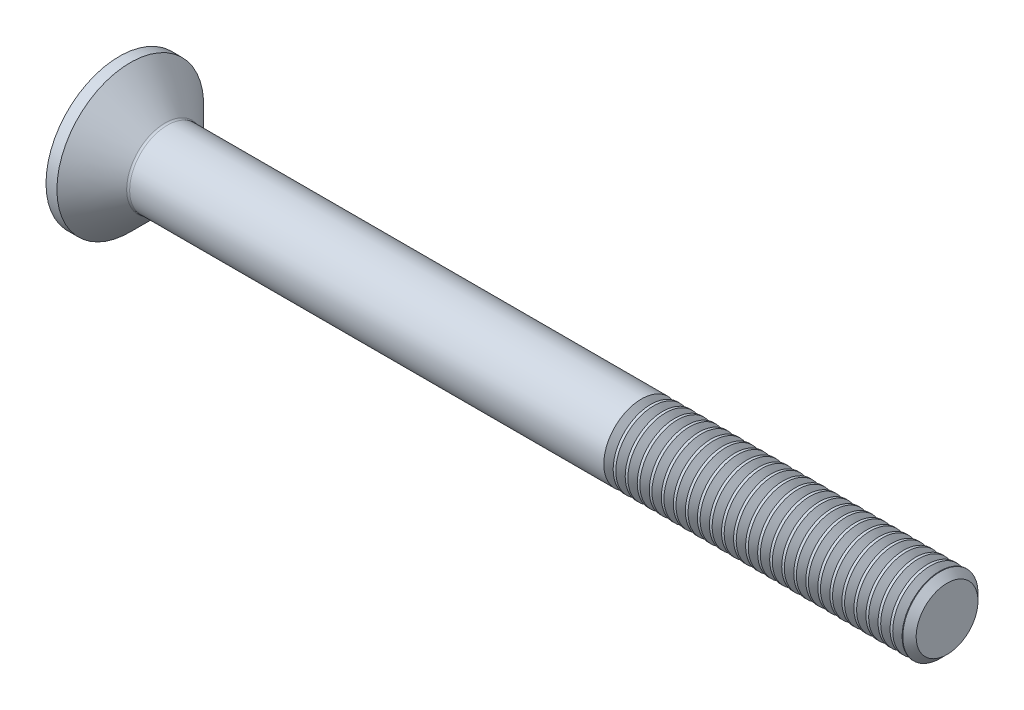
ISO-10303-21;
HEADER;
FILE_DESCRIPTION(('STEP AP214'),'2;1');
FILE_NAME('part.step','',(''),(''),'','','');
FILE_SCHEMA(('AUTOMOTIVE_DESIGN { 1 0 10303 214 1 1 1 1 }'));
ENDSEC;
DATA;
#1=APPLICATION_CONTEXT('core data for automotive mechanical design processes');
#2=APPLICATION_PROTOCOL_DEFINITION('international standard','automotive_design',2000,#1);
#3=PRODUCT_CONTEXT('',#1,'mechanical');
#4=PRODUCT('Part','Part','',(#3));
#5=PRODUCT_RELATED_PRODUCT_CATEGORY('part','',(#4));
#6=PRODUCT_DEFINITION_FORMATION('','',#4);
#7=PRODUCT_DEFINITION_CONTEXT('part definition',#1,'design');
#8=PRODUCT_DEFINITION('design','',#6,#7);
#9=PRODUCT_DEFINITION_SHAPE('','',#8);
#10=(LENGTH_UNIT() NAMED_UNIT(*) SI_UNIT(.MILLI.,.METRE.));
#11=(NAMED_UNIT(*) PLANE_ANGLE_UNIT() SI_UNIT($,.RADIAN.));
#12=(NAMED_UNIT(*) SI_UNIT($,.STERADIAN.) SOLID_ANGLE_UNIT());
#13=UNCERTAINTY_MEASURE_WITH_UNIT(LENGTH_MEASURE(1.E-05),#10,'distance_accuracy_value','');
#14=(GEOMETRIC_REPRESENTATION_CONTEXT(3) GLOBAL_UNCERTAINTY_ASSIGNED_CONTEXT((#13)) GLOBAL_UNIT_ASSIGNED_CONTEXT((#10,
#11,#12)) REPRESENTATION_CONTEXT('',''));
#15=CARTESIAN_POINT('',(0.,0.,0.));
#16=DIRECTION('',(0.,0.,1.));
#17=DIRECTION('',(1.,0.,0.));
#18=AXIS2_PLACEMENT_3D('',#15,#16,#17);
#19=CARTESIAN_POINT('',(55.,2.055,0.));
#20=DIRECTION('',(1.,0.,0.));
#21=DIRECTION('',(0.,0.,-1.));
#22=AXIS2_PLACEMENT_3D('',#19,#20,#21);
#23=PLANE('',#22);
#24=CARTESIAN_POINT('',(55.0000000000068,0.,0.));
#25=DIRECTION('',(-1.,0.,0.));
#26=DIRECTION('',(0.,0.,1.));
#27=AXIS2_PLACEMENT_3D('',#24,#25,#26);
#28=CIRCLE('',#27,2.05499999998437);
#29=CARTESIAN_POINT('',(55.0000000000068,0.,2.05499999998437));
#30=VERTEX_POINT('',#29);
#31=EDGE_CURVE('E20',#30,#30,#28,.T.);
#32=ORIENTED_EDGE('',*,*,#31,.F.);
#33=EDGE_LOOP('',(#32));
#34=FACE_BOUND('',#33,.T.);
#35=ADVANCED_FACE('F17',(#34),#23,.T.);
#36=CARTESIAN_POINT('',(54.5550000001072,0.,0.));
#37=DIRECTION('',(-1.,0.,0.));
#38=DIRECTION('',(0.,0.,1.));
#39=AXIS2_PLACEMENT_3D('',#36,#37,#38);
#40=CONICAL_SURFACE('',#39,2.49999999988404,0.785398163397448);
#41=CARTESIAN_POINT('',(54.555,0.,0.));
#42=DIRECTION('',(-1.,0.,0.));
#43=DIRECTION('',(0.,0.,1.));
#44=AXIS2_PLACEMENT_3D('',#41,#42,#43);
#45=CIRCLE('',#44,2.49999999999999);
#46=CARTESIAN_POINT('',(54.555,0.,2.49999999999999));
#47=VERTEX_POINT('',#46);
#48=EDGE_CURVE('E348',#47,#47,#45,.T.);
#49=ORIENTED_EDGE('',*,*,#48,.F.);
#50=EDGE_LOOP('',(#49));
#51=FACE_BOUND('',#50,.T.);
#52=ORIENTED_EDGE('',*,*,#31,.T.);
#53=EDGE_LOOP('',(#52));
#54=FACE_BOUND('',#53,.T.);
#55=ADVANCED_FACE('F1345',(#51,#54),#40,.T.);
#56=CARTESIAN_POINT('',(0.,0.,0.));
#57=DIRECTION('',(-1.,0.,0.));
#58=DIRECTION('',(0.,0.,1.));
#59=AXIS2_PLACEMENT_3D('',#56,#57,#58);
#60=CYLINDRICAL_SURFACE('',#59,2.49999999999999);
#61=CARTESIAN_POINT('',(54.5115933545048,0.,0.));
#62=DIRECTION('',(1.,0.,0.));
#63=DIRECTION('',(0.,1.,0.));
#64=AXIS2_PLACEMENT_3D('',#61,#62,#63);
#65=CIRCLE('',#64,2.49999999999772);
#66=CARTESIAN_POINT('',(54.5115933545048,2.49999999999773,0.));
#67=VERTEX_POINT('',#66);
#68=EDGE_CURVE('E345',#67,#67,#65,.F.);
#69=ORIENTED_EDGE('',*,*,#68,.F.);
#70=EDGE_LOOP('',(#69));
#71=FACE_BOUND('',#70,.T.);
#72=ORIENTED_EDGE('',*,*,#48,.T.);
#73=EDGE_LOOP('',(#72));
#74=FACE_BOUND('',#73,.T.);
#75=ADVANCED_FACE('F1336',(#71,#74),#60,.T.);
#76=CARTESIAN_POINT('',(54.5115933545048,0.,0.));
#77=DIRECTION('',(1.,0.,0.));
#78=DIRECTION('',(0.,0.,-1.));
#79=AXIS2_PLACEMENT_3D('',#76,#77,#78);
#80=CONICAL_SURFACE('',#79,2.49999999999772,0.959931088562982);
#81=ORIENTED_EDGE('',*,*,#68,.T.);
#82=EDGE_LOOP('',(#81));
#83=FACE_BOUND('',#82,.T.);
#84=CARTESIAN_POINT('',(54.2000010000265,0.,0.));
#85=DIRECTION('',(-1.,0.,0.));
#86=DIRECTION('',(0.,-1.,0.));
#87=AXIS2_PLACEMENT_3D('',#84,#85,#86);
#88=CIRCLE('',#87,2.05499999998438);
#89=CARTESIAN_POINT('',(54.2000010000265,-2.05499999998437,0.));
#90=VERTEX_POINT('',#89);
#91=EDGE_CURVE('E342',#90,#90,#88,.T.);
#92=ORIENTED_EDGE('',*,*,#91,.F.);
#93=EDGE_LOOP('',(#92));
#94=FACE_BOUND('',#93,.T.);
#95=ADVANCED_FACE('F1327',(#83,#94),#80,.T.);
#96=CARTESIAN_POINT('',(53.8884086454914,0.,0.));
#97=DIRECTION('',(-1.,0.,0.));
#98=DIRECTION('',(0.,0.,1.));
#99=AXIS2_PLACEMENT_3D('',#96,#97,#98);
#100=CONICAL_SURFACE('',#99,2.50000000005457,0.959931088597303);
#101=CARTESIAN_POINT('',(53.8884086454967,0.,0.));
#102=DIRECTION('',(-1.,0.,0.));
#103=DIRECTION('',(0.,0.,1.));
#104=AXIS2_PLACEMENT_3D('',#101,#102,#103);
#105=CIRCLE('',#104,2.49999999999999);
#106=CARTESIAN_POINT('',(53.8884086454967,0.,2.49999999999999));
#107=VERTEX_POINT('',#106);
#108=EDGE_CURVE('E339',#107,#107,#105,.T.);
#109=ORIENTED_EDGE('',*,*,#108,.F.);
#110=EDGE_LOOP('',(#109));
#111=FACE_BOUND('',#110,.T.);
#112=ORIENTED_EDGE('',*,*,#91,.T.);
#113=EDGE_LOOP('',(#112));
#114=FACE_BOUND('',#113,.T.);
#115=ADVANCED_FACE('F1318',(#111,#114),#100,.T.);
#116=CARTESIAN_POINT('',(0.,0.,0.));
#117=DIRECTION('',(-1.,0.,0.));
#118=DIRECTION('',(0.,0.,1.));
#119=AXIS2_PLACEMENT_3D('',#116,#117,#118);
#120=CYLINDRICAL_SURFACE('',#119,2.49999999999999);
#121=ORIENTED_EDGE('',*,*,#108,.T.);
#122=EDGE_LOOP('',(#121));
#123=FACE_BOUND('',#122,.T.);
#124=CARTESIAN_POINT('',(53.7115933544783,0.,0.));
#125=DIRECTION('',(1.,0.,0.));
#126=DIRECTION('',(0.,1.,0.));
#127=AXIS2_PLACEMENT_3D('',#124,#125,#126);
#128=CIRCLE('',#127,2.49999999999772);
#129=CARTESIAN_POINT('',(53.7115933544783,2.49999999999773,0.));
#130=VERTEX_POINT('',#129);
#131=EDGE_CURVE('E336',#130,#130,#128,.F.);
#132=ORIENTED_EDGE('',*,*,#131,.F.);
#133=EDGE_LOOP('',(#132));
#134=FACE_BOUND('',#133,.T.);
#135=ADVANCED_FACE('F1309',(#123,#134),#120,.T.);
#136=CARTESIAN_POINT('',(53.7115933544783,0.,0.));
#137=DIRECTION('',(1.,0.,0.));
#138=DIRECTION('',(0.,0.,-1.));
#139=AXIS2_PLACEMENT_3D('',#136,#137,#138);
#140=CONICAL_SURFACE('',#139,2.49999999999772,0.959931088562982);
#141=CARTESIAN_POINT('',(53.400001,0.,0.));
#142=DIRECTION('',(-1.,0.,0.));
#143=DIRECTION('',(0.,-1.,0.));
#144=AXIS2_PLACEMENT_3D('',#141,#142,#143);
#145=CIRCLE('',#144,2.05499999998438);
#146=CARTESIAN_POINT('',(53.400001,-2.05499999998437,0.));
#147=VERTEX_POINT('',#146);
#148=EDGE_CURVE('E333',#147,#147,#145,.T.);
#149=ORIENTED_EDGE('',*,*,#148,.F.);
#150=EDGE_LOOP('',(#149));
#151=FACE_BOUND('',#150,.T.);
#152=ORIENTED_EDGE('',*,*,#131,.T.);
#153=EDGE_LOOP('',(#152));
#154=FACE_BOUND('',#153,.T.);
#155=ADVANCED_FACE('F1300',(#151,#154),#140,.T.);
#156=CARTESIAN_POINT('',(53.0884086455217,0.,0.));
#157=DIRECTION('',(-1.,0.,0.));
#158=DIRECTION('',(0.,0.,1.));
#159=AXIS2_PLACEMENT_3D('',#156,#157,#158);
#160=CONICAL_SURFACE('',#159,2.49999999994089,0.959931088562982);
#161=ORIENTED_EDGE('',*,*,#148,.T.);
#162=EDGE_LOOP('',(#161));
#163=FACE_BOUND('',#162,.T.);
#164=CARTESIAN_POINT('',(53.0884086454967,0.,0.));
#165=DIRECTION('',(-1.,0.,0.));
#166=DIRECTION('',(0.,0.,1.));
#167=AXIS2_PLACEMENT_3D('',#164,#165,#166);
#168=CIRCLE('',#167,2.49999999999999);
#169=CARTESIAN_POINT('',(53.0884086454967,0.,2.49999999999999));
#170=VERTEX_POINT('',#169);
#171=EDGE_CURVE('E330',#170,#170,#168,.T.);
#172=ORIENTED_EDGE('',*,*,#171,.F.);
#173=EDGE_LOOP('',(#172));
#174=FACE_BOUND('',#173,.T.);
#175=ADVANCED_FACE('F1291',(#163,#174),#160,.T.);
#176=CARTESIAN_POINT('',(0.,0.,0.));
#177=DIRECTION('',(-1.,0.,0.));
#178=DIRECTION('',(0.,0.,1.));
#179=AXIS2_PLACEMENT_3D('',#176,#177,#178);
#180=CYLINDRICAL_SURFACE('',#179,2.49999999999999);
#181=CARTESIAN_POINT('',(52.9115933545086,0.,0.));
#182=DIRECTION('',(1.,0.,0.));
#183=DIRECTION('',(0.,1.,0.));
#184=AXIS2_PLACEMENT_3D('',#181,#182,#183);
#185=CIRCLE('',#184,2.49999999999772);
#186=CARTESIAN_POINT('',(52.9115933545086,2.49999999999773,0.));
#187=VERTEX_POINT('',#186);
#188=EDGE_CURVE('E327',#187,#187,#185,.F.);
#189=ORIENTED_EDGE('',*,*,#188,.F.);
#190=EDGE_LOOP('',(#189));
#191=FACE_BOUND('',#190,.T.);
#192=ORIENTED_EDGE('',*,*,#171,.T.);
#193=EDGE_LOOP('',(#192));
#194=FACE_BOUND('',#193,.T.);
#195=ADVANCED_FACE('F1282',(#191,#194),#180,.T.);
#196=CARTESIAN_POINT('',(52.9115933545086,0.,0.));
#197=DIRECTION('',(1.,0.,0.));
#198=DIRECTION('',(0.,0.,-1.));
#199=AXIS2_PLACEMENT_3D('',#196,#197,#198);
#200=CONICAL_SURFACE('',#199,2.49999999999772,0.959931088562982);
#201=ORIENTED_EDGE('',*,*,#188,.T.);
#202=EDGE_LOOP('',(#201));
#203=FACE_BOUND('',#202,.T.);
#204=CARTESIAN_POINT('',(52.6000009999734,0.,0.));
#205=DIRECTION('',(-1.,0.,0.));
#206=DIRECTION('',(0.,-1.,0.));
#207=AXIS2_PLACEMENT_3D('',#204,#205,#206);
#208=CIRCLE('',#207,2.05499999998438);
#209=CARTESIAN_POINT('',(52.6000009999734,-2.05499999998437,0.));
#210=VERTEX_POINT('',#209);
#211=EDGE_CURVE('E324',#210,#210,#208,.T.);
#212=ORIENTED_EDGE('',*,*,#211,.F.);
#213=EDGE_LOOP('',(#212));
#214=FACE_BOUND('',#213,.T.);
#215=ADVANCED_FACE('F1273',(#203,#214),#200,.T.);
#216=CARTESIAN_POINT('',(52.2884086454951,0.,0.));
#217=DIRECTION('',(-1.,0.,0.));
#218=DIRECTION('',(0.,0.,1.));
#219=AXIS2_PLACEMENT_3D('',#216,#217,#218);
#220=CONICAL_SURFACE('',#219,2.49999999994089,0.959931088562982);
#221=CARTESIAN_POINT('',(52.2884086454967,0.,0.));
#222=DIRECTION('',(-1.,0.,0.));
#223=DIRECTION('',(0.,0.,1.));
#224=AXIS2_PLACEMENT_3D('',#221,#222,#223);
#225=CIRCLE('',#224,2.49999999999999);
#226=CARTESIAN_POINT('',(52.2884086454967,0.,2.49999999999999));
#227=VERTEX_POINT('',#226);
#228=EDGE_CURVE('E321',#227,#227,#225,.T.);
#229=ORIENTED_EDGE('',*,*,#228,.F.);
#230=EDGE_LOOP('',(#229));
#231=FACE_BOUND('',#230,.T.);
#232=ORIENTED_EDGE('',*,*,#211,.T.);
#233=EDGE_LOOP('',(#232));
#234=FACE_BOUND('',#233,.T.);
#235=ADVANCED_FACE('F1264',(#231,#234),#220,.T.);
#236=CARTESIAN_POINT('',(0.,0.,0.));
#237=DIRECTION('',(-1.,0.,0.));
#238=DIRECTION('',(0.,0.,1.));
#239=AXIS2_PLACEMENT_3D('',#236,#237,#238);
#240=CYLINDRICAL_SURFACE('',#239,2.49999999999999);
#241=ORIENTED_EDGE('',*,*,#228,.T.);
#242=EDGE_LOOP('',(#241));
#243=FACE_BOUND('',#242,.T.);
#244=CARTESIAN_POINT('',(52.111593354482,0.,0.));
#245=DIRECTION('',(1.,0.,0.));
#246=DIRECTION('',(0.,1.,0.));
#247=AXIS2_PLACEMENT_3D('',#244,#245,#246);
#248=CIRCLE('',#247,2.49999999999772);
#249=CARTESIAN_POINT('',(52.111593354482,2.49999999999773,0.));
#250=VERTEX_POINT('',#249);
#251=EDGE_CURVE('E318',#250,#250,#248,.F.);
#252=ORIENTED_EDGE('',*,*,#251,.F.);
#253=EDGE_LOOP('',(#252));
#254=FACE_BOUND('',#253,.T.);
#255=ADVANCED_FACE('F1255',(#243,#254),#240,.T.);
#256=CARTESIAN_POINT('',(52.111593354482,0.,0.));
#257=DIRECTION('',(1.,0.,0.));
#258=DIRECTION('',(0.,0.,-1.));
#259=AXIS2_PLACEMENT_3D('',#256,#257,#258);
#260=CONICAL_SURFACE('',#259,2.49999999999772,0.959931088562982);
#261=CARTESIAN_POINT('',(51.8000010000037,0.,0.));
#262=DIRECTION('',(-1.,0.,0.));
#263=DIRECTION('',(0.,-1.,0.));
#264=AXIS2_PLACEMENT_3D('',#261,#262,#263);
#265=CIRCLE('',#264,2.05499999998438);
#266=CARTESIAN_POINT('',(51.8000010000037,-2.05499999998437,0.));
#267=VERTEX_POINT('',#266);
#268=EDGE_CURVE('E315',#267,#267,#265,.T.);
#269=ORIENTED_EDGE('',*,*,#268,.F.);
#270=EDGE_LOOP('',(#269));
#271=FACE_BOUND('',#270,.T.);
#272=ORIENTED_EDGE('',*,*,#251,.T.);
#273=EDGE_LOOP('',(#272));
#274=FACE_BOUND('',#273,.T.);
#275=ADVANCED_FACE('F1246',(#271,#274),#260,.T.);
#276=CARTESIAN_POINT('',(51.4884086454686,0.,0.));
#277=DIRECTION('',(-1.,0.,0.));
#278=DIRECTION('',(0.,0.,1.));
#279=AXIS2_PLACEMENT_3D('',#276,#277,#278);
#280=CONICAL_SURFACE('',#279,2.50000000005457,0.959931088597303);
#281=ORIENTED_EDGE('',*,*,#268,.T.);
#282=EDGE_LOOP('',(#281));
#283=FACE_BOUND('',#282,.T.);
#284=CARTESIAN_POINT('',(51.4884086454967,0.,0.));
#285=DIRECTION('',(-1.,0.,0.));
#286=DIRECTION('',(0.,0.,1.));
#287=AXIS2_PLACEMENT_3D('',#284,#285,#286);
#288=CIRCLE('',#287,2.49999999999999);
#289=CARTESIAN_POINT('',(51.4884086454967,0.,2.49999999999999));
#290=VERTEX_POINT('',#289);
#291=EDGE_CURVE('E312',#290,#290,#288,.T.);
#292=ORIENTED_EDGE('',*,*,#291,.F.);
#293=EDGE_LOOP('',(#292));
#294=FACE_BOUND('',#293,.T.);
#295=ADVANCED_FACE('F1237',(#283,#294),#280,.T.);
#296=CARTESIAN_POINT('',(0.,0.,0.));
#297=DIRECTION('',(-1.,0.,0.));
#298=DIRECTION('',(0.,0.,1.));
#299=AXIS2_PLACEMENT_3D('',#296,#297,#298);
#300=CYLINDRICAL_SURFACE('',#299,2.49999999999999);
#301=CARTESIAN_POINT('',(51.3115933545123,0.,0.));
#302=DIRECTION('',(1.,0.,0.));
#303=DIRECTION('',(0.,1.,0.));
#304=AXIS2_PLACEMENT_3D('',#301,#302,#303);
#305=CIRCLE('',#304,2.49999999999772);
#306=CARTESIAN_POINT('',(51.3115933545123,2.49999999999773,0.));
#307=VERTEX_POINT('',#306);
#308=EDGE_CURVE('E309',#307,#307,#305,.F.);
#309=ORIENTED_EDGE('',*,*,#308,.F.);
#310=EDGE_LOOP('',(#309));
#311=FACE_BOUND('',#310,.T.);
#312=ORIENTED_EDGE('',*,*,#291,.T.);
#313=EDGE_LOOP('',(#312));
#314=FACE_BOUND('',#313,.T.);
#315=ADVANCED_FACE('F1228',(#311,#314),#300,.T.);
#316=CARTESIAN_POINT('',(51.3115933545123,0.,0.));
#317=DIRECTION('',(1.,0.,0.));
#318=DIRECTION('',(0.,0.,-1.));
#319=AXIS2_PLACEMENT_3D('',#316,#317,#318);
#320=CONICAL_SURFACE('',#319,2.49999999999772,0.959931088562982);
#321=ORIENTED_EDGE('',*,*,#308,.T.);
#322=EDGE_LOOP('',(#321));
#323=FACE_BOUND('',#322,.T.);
#324=CARTESIAN_POINT('',(51.0000009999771,0.,0.));
#325=DIRECTION('',(-1.,0.,0.));
#326=DIRECTION('',(0.,-1.,0.));
#327=AXIS2_PLACEMENT_3D('',#324,#325,#326);
#328=CIRCLE('',#327,2.05499999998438);
#329=CARTESIAN_POINT('',(51.0000009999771,-2.05499999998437,0.));
#330=VERTEX_POINT('',#329);
#331=EDGE_CURVE('E306',#330,#330,#328,.T.);
#332=ORIENTED_EDGE('',*,*,#331,.F.);
#333=EDGE_LOOP('',(#332));
#334=FACE_BOUND('',#333,.T.);
#335=ADVANCED_FACE('F1219',(#323,#334),#320,.T.);
#336=CARTESIAN_POINT('',(50.6884086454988,0.,0.));
#337=DIRECTION('',(-1.,0.,0.));
#338=DIRECTION('',(0.,0.,1.));
#339=AXIS2_PLACEMENT_3D('',#336,#337,#338);
#340=CONICAL_SURFACE('',#339,2.49999999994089,0.959931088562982);
#341=CARTESIAN_POINT('',(50.6884086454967,0.,0.));
#342=DIRECTION('',(-1.,0.,0.));
#343=DIRECTION('',(0.,0.,1.));
#344=AXIS2_PLACEMENT_3D('',#341,#342,#343);
#345=CIRCLE('',#344,2.49999999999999);
#346=CARTESIAN_POINT('',(50.6884086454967,0.,2.49999999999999));
#347=VERTEX_POINT('',#346);
#348=EDGE_CURVE('E303',#347,#347,#345,.T.);
#349=ORIENTED_EDGE('',*,*,#348,.F.);
#350=EDGE_LOOP('',(#349));
#351=FACE_BOUND('',#350,.T.);
#352=ORIENTED_EDGE('',*,*,#331,.T.);
#353=EDGE_LOOP('',(#352));
#354=FACE_BOUND('',#353,.T.);
#355=ADVANCED_FACE('F1210',(#351,#354),#340,.T.);
#356=CARTESIAN_POINT('',(0.,0.,0.));
#357=DIRECTION('',(-1.,0.,0.));
#358=DIRECTION('',(0.,0.,1.));
#359=AXIS2_PLACEMENT_3D('',#356,#357,#358);
#360=CYLINDRICAL_SURFACE('',#359,2.49999999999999);
#361=ORIENTED_EDGE('',*,*,#348,.T.);
#362=EDGE_LOOP('',(#361));
#363=FACE_BOUND('',#362,.T.);
#364=CARTESIAN_POINT('',(50.5115933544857,0.,0.));
#365=DIRECTION('',(1.,0.,0.));
#366=DIRECTION('',(0.,1.,0.));
#367=AXIS2_PLACEMENT_3D('',#364,#365,#366);
#368=CIRCLE('',#367,2.49999999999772);
#369=CARTESIAN_POINT('',(50.5115933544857,2.49999999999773,0.));
#370=VERTEX_POINT('',#369);
#371=EDGE_CURVE('E300',#370,#370,#368,.F.);
#372=ORIENTED_EDGE('',*,*,#371,.F.);
#373=EDGE_LOOP('',(#372));
#374=FACE_BOUND('',#373,.T.);
#375=ADVANCED_FACE('F1201',(#363,#374),#360,.T.);
#376=CARTESIAN_POINT('',(50.5115933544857,0.,0.));
#377=DIRECTION('',(1.,0.,0.));
#378=DIRECTION('',(0.,0.,-1.));
#379=AXIS2_PLACEMENT_3D('',#376,#377,#378);
#380=CONICAL_SURFACE('',#379,2.49999999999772,0.959931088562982);
#381=CARTESIAN_POINT('',(50.2000010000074,0.,0.));
#382=DIRECTION('',(-1.,0.,0.));
#383=DIRECTION('',(0.,-1.,0.));
#384=AXIS2_PLACEMENT_3D('',#381,#382,#383);
#385=CIRCLE('',#384,2.05499999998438);
#386=CARTESIAN_POINT('',(50.2000010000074,-2.05499999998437,0.));
#387=VERTEX_POINT('',#386);
#388=EDGE_CURVE('E297',#387,#387,#385,.T.);
#389=ORIENTED_EDGE('',*,*,#388,.F.);
#390=EDGE_LOOP('',(#389));
#391=FACE_BOUND('',#390,.T.);
#392=ORIENTED_EDGE('',*,*,#371,.T.);
#393=EDGE_LOOP('',(#392));
#394=FACE_BOUND('',#393,.T.);
#395=ADVANCED_FACE('F1192',(#391,#394),#380,.T.);
#396=CARTESIAN_POINT('',(49.8884086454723,0.,0.));
#397=DIRECTION('',(-1.,0.,0.));
#398=DIRECTION('',(0.,0.,1.));
#399=AXIS2_PLACEMENT_3D('',#396,#397,#398);
#400=CONICAL_SURFACE('',#399,2.50000000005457,0.959931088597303);
#401=ORIENTED_EDGE('',*,*,#388,.T.);
#402=EDGE_LOOP('',(#401));
#403=FACE_BOUND('',#402,.T.);
#404=CARTESIAN_POINT('',(49.8884086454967,0.,0.));
#405=DIRECTION('',(-1.,0.,0.));
#406=DIRECTION('',(0.,0.,1.));
#407=AXIS2_PLACEMENT_3D('',#404,#405,#406);
#408=CIRCLE('',#407,2.49999999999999);
#409=CARTESIAN_POINT('',(49.8884086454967,0.,2.49999999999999));
#410=VERTEX_POINT('',#409);
#411=EDGE_CURVE('E294',#410,#410,#408,.T.);
#412=ORIENTED_EDGE('',*,*,#411,.F.);
#413=EDGE_LOOP('',(#412));
#414=FACE_BOUND('',#413,.T.);
#415=ADVANCED_FACE('F1183',(#403,#414),#400,.T.);
#416=CARTESIAN_POINT('',(0.,0.,0.));
#417=DIRECTION('',(-1.,0.,0.));
#418=DIRECTION('',(0.,0.,1.));
#419=AXIS2_PLACEMENT_3D('',#416,#417,#418);
#420=CYLINDRICAL_SURFACE('',#419,2.49999999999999);
#421=CARTESIAN_POINT('',(49.711593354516,0.,0.));
#422=DIRECTION('',(1.,0.,0.));
#423=DIRECTION('',(0.,1.,0.));
#424=AXIS2_PLACEMENT_3D('',#421,#422,#423);
#425=CIRCLE('',#424,2.49999999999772);
#426=CARTESIAN_POINT('',(49.711593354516,2.49999999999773,0.));
#427=VERTEX_POINT('',#426);
#428=EDGE_CURVE('E291',#427,#427,#425,.F.);
#429=ORIENTED_EDGE('',*,*,#428,.F.);
#430=EDGE_LOOP('',(#429));
#431=FACE_BOUND('',#430,.T.);
#432=ORIENTED_EDGE('',*,*,#411,.T.);
#433=EDGE_LOOP('',(#432));
#434=FACE_BOUND('',#433,.T.);
#435=ADVANCED_FACE('F1174',(#431,#434),#420,.T.);
#436=CARTESIAN_POINT('',(49.711593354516,0.,0.));
#437=DIRECTION('',(1.,0.,0.));
#438=DIRECTION('',(0.,0.,-1.));
#439=AXIS2_PLACEMENT_3D('',#436,#437,#438);
#440=CONICAL_SURFACE('',#439,2.49999999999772,0.959931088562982);
#441=ORIENTED_EDGE('',*,*,#428,.T.);
#442=EDGE_LOOP('',(#441));
#443=FACE_BOUND('',#442,.T.);
#444=CARTESIAN_POINT('',(49.4000009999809,0.,0.));
#445=DIRECTION('',(-1.,0.,0.));
#446=DIRECTION('',(0.,-1.,0.));
#447=AXIS2_PLACEMENT_3D('',#444,#445,#446);
#448=CIRCLE('',#447,2.05499999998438);
#449=CARTESIAN_POINT('',(49.4000009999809,-2.05499999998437,0.));
#450=VERTEX_POINT('',#449);
#451=EDGE_CURVE('E288',#450,#450,#448,.T.);
#452=ORIENTED_EDGE('',*,*,#451,.F.);
#453=EDGE_LOOP('',(#452));
#454=FACE_BOUND('',#453,.T.);
#455=ADVANCED_FACE('F1165',(#443,#454),#440,.T.);
#456=CARTESIAN_POINT('',(49.0884086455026,0.,0.));
#457=DIRECTION('',(-1.,0.,0.));
#458=DIRECTION('',(0.,0.,1.));
#459=AXIS2_PLACEMENT_3D('',#456,#457,#458);
#460=CONICAL_SURFACE('',#459,2.49999999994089,0.959931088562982);
#461=CARTESIAN_POINT('',(49.0884086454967,0.,0.));
#462=DIRECTION('',(-1.,0.,0.));
#463=DIRECTION('',(0.,0.,1.));
#464=AXIS2_PLACEMENT_3D('',#461,#462,#463);
#465=CIRCLE('',#464,2.49999999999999);
#466=CARTESIAN_POINT('',(49.0884086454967,0.,2.49999999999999));
#467=VERTEX_POINT('',#466);
#468=EDGE_CURVE('E285',#467,#467,#465,.T.);
#469=ORIENTED_EDGE('',*,*,#468,.F.);
#470=EDGE_LOOP('',(#469));
#471=FACE_BOUND('',#470,.T.);
#472=ORIENTED_EDGE('',*,*,#451,.T.);
#473=EDGE_LOOP('',(#472));
#474=FACE_BOUND('',#473,.T.);
#475=ADVANCED_FACE('F1156',(#471,#474),#460,.T.);
#476=CARTESIAN_POINT('',(0.,0.,0.));
#477=DIRECTION('',(-1.,0.,0.));
#478=DIRECTION('',(0.,0.,1.));
#479=AXIS2_PLACEMENT_3D('',#476,#477,#478);
#480=CYLINDRICAL_SURFACE('',#479,2.49999999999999);
#481=ORIENTED_EDGE('',*,*,#468,.T.);
#482=EDGE_LOOP('',(#481));
#483=FACE_BOUND('',#482,.T.);
#484=CARTESIAN_POINT('',(48.9115933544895,0.,0.));
#485=DIRECTION('',(1.,0.,0.));
#486=DIRECTION('',(0.,1.,0.));
#487=AXIS2_PLACEMENT_3D('',#484,#485,#486);
#488=CIRCLE('',#487,2.49999999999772);
#489=CARTESIAN_POINT('',(48.9115933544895,2.49999999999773,0.));
#490=VERTEX_POINT('',#489);
#491=EDGE_CURVE('E282',#490,#490,#488,.F.);
#492=ORIENTED_EDGE('',*,*,#491,.F.);
#493=EDGE_LOOP('',(#492));
#494=FACE_BOUND('',#493,.T.);
#495=ADVANCED_FACE('F1147',(#483,#494),#480,.T.);
#496=CARTESIAN_POINT('',(48.9115933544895,0.,0.));
#497=DIRECTION('',(1.,0.,0.));
#498=DIRECTION('',(0.,0.,-1.));
#499=AXIS2_PLACEMENT_3D('',#496,#497,#498);
#500=CONICAL_SURFACE('',#499,2.49999999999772,0.959931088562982);
#501=CARTESIAN_POINT('',(48.6000010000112,0.,0.));
#502=DIRECTION('',(-1.,0.,0.));
#503=DIRECTION('',(0.,-1.,0.));
#504=AXIS2_PLACEMENT_3D('',#501,#502,#503);
#505=CIRCLE('',#504,2.05499999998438);
#506=CARTESIAN_POINT('',(48.6000010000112,-2.05499999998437,0.));
#507=VERTEX_POINT('',#506);
#508=EDGE_CURVE('E279',#507,#507,#505,.T.);
#509=ORIENTED_EDGE('',*,*,#508,.F.);
#510=EDGE_LOOP('',(#509));
#511=FACE_BOUND('',#510,.T.);
#512=ORIENTED_EDGE('',*,*,#491,.T.);
#513=EDGE_LOOP('',(#512));
#514=FACE_BOUND('',#513,.T.);
#515=ADVANCED_FACE('F1138',(#511,#514),#500,.T.);
#516=CARTESIAN_POINT('',(48.288408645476,0.,0.));
#517=DIRECTION('',(-1.,0.,0.));
#518=DIRECTION('',(0.,0.,1.));
#519=AXIS2_PLACEMENT_3D('',#516,#517,#518);
#520=CONICAL_SURFACE('',#519,2.50000000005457,0.959931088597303);
#521=ORIENTED_EDGE('',*,*,#508,.T.);
#522=EDGE_LOOP('',(#521));
#523=FACE_BOUND('',#522,.T.);
#524=CARTESIAN_POINT('',(48.2884086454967,0.,0.));
#525=DIRECTION('',(-1.,0.,0.));
#526=DIRECTION('',(0.,0.,1.));
#527=AXIS2_PLACEMENT_3D('',#524,#525,#526);
#528=CIRCLE('',#527,2.49999999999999);
#529=CARTESIAN_POINT('',(48.2884086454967,0.,2.49999999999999));
#530=VERTEX_POINT('',#529);
#531=EDGE_CURVE('E276',#530,#530,#528,.T.);
#532=ORIENTED_EDGE('',*,*,#531,.F.);
#533=EDGE_LOOP('',(#532));
#534=FACE_BOUND('',#533,.T.);
#535=ADVANCED_FACE('F1129',(#523,#534),#520,.T.);
#536=CARTESIAN_POINT('',(0.,0.,0.));
#537=DIRECTION('',(-1.,0.,0.));
#538=DIRECTION('',(0.,0.,1.));
#539=AXIS2_PLACEMENT_3D('',#536,#537,#538);
#540=CYLINDRICAL_SURFACE('',#539,2.49999999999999);
#541=CARTESIAN_POINT('',(48.1115933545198,0.,0.));
#542=DIRECTION('',(1.,0.,0.));
#543=DIRECTION('',(0.,1.,0.));
#544=AXIS2_PLACEMENT_3D('',#541,#542,#543);
#545=CIRCLE('',#544,2.49999999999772);
#546=CARTESIAN_POINT('',(48.1115933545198,2.49999999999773,0.));
#547=VERTEX_POINT('',#546);
#548=EDGE_CURVE('E273',#547,#547,#545,.F.);
#549=ORIENTED_EDGE('',*,*,#548,.F.);
#550=EDGE_LOOP('',(#549));
#551=FACE_BOUND('',#550,.T.);
#552=ORIENTED_EDGE('',*,*,#531,.T.);
#553=EDGE_LOOP('',(#552));
#554=FACE_BOUND('',#553,.T.);
#555=ADVANCED_FACE('F1120',(#551,#554),#540,.T.);
#556=CARTESIAN_POINT('',(48.1115933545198,0.,0.));
#557=DIRECTION('',(1.,0.,0.));
#558=DIRECTION('',(0.,0.,-1.));
#559=AXIS2_PLACEMENT_3D('',#556,#557,#558);
#560=CONICAL_SURFACE('',#559,2.49999999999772,0.959931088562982);
#561=ORIENTED_EDGE('',*,*,#548,.T.);
#562=EDGE_LOOP('',(#561));
#563=FACE_BOUND('',#562,.T.);
#564=CARTESIAN_POINT('',(47.8000009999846,0.,0.));
#565=DIRECTION('',(-1.,0.,0.));
#566=DIRECTION('',(0.,-1.,0.));
#567=AXIS2_PLACEMENT_3D('',#564,#565,#566);
#568=CIRCLE('',#567,2.05499999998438);
#569=CARTESIAN_POINT('',(47.8000009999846,-2.05499999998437,0.));
#570=VERTEX_POINT('',#569);
#571=EDGE_CURVE('E270',#570,#570,#568,.T.);
#572=ORIENTED_EDGE('',*,*,#571,.F.);
#573=EDGE_LOOP('',(#572));
#574=FACE_BOUND('',#573,.T.);
#575=ADVANCED_FACE('F1111',(#563,#574),#560,.T.);
#576=CARTESIAN_POINT('',(47.4884086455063,0.,0.));
#577=DIRECTION('',(-1.,0.,0.));
#578=DIRECTION('',(0.,0.,1.));
#579=AXIS2_PLACEMENT_3D('',#576,#577,#578);
#580=CONICAL_SURFACE('',#579,2.49999999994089,0.959931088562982);
#581=CARTESIAN_POINT('',(47.4884086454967,0.,0.));
#582=DIRECTION('',(-1.,0.,0.));
#583=DIRECTION('',(0.,0.,1.));
#584=AXIS2_PLACEMENT_3D('',#581,#582,#583);
#585=CIRCLE('',#584,2.49999999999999);
#586=CARTESIAN_POINT('',(47.4884086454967,0.,2.49999999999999));
#587=VERTEX_POINT('',#586);
#588=EDGE_CURVE('E267',#587,#587,#585,.T.);
#589=ORIENTED_EDGE('',*,*,#588,.F.);
#590=EDGE_LOOP('',(#589));
#591=FACE_BOUND('',#590,.T.);
#592=ORIENTED_EDGE('',*,*,#571,.T.);
#593=EDGE_LOOP('',(#592));
#594=FACE_BOUND('',#593,.T.);
#595=ADVANCED_FACE('F1102',(#591,#594),#580,.T.);
#596=CARTESIAN_POINT('',(0.,0.,0.));
#597=DIRECTION('',(-1.,0.,0.));
#598=DIRECTION('',(0.,0.,1.));
#599=AXIS2_PLACEMENT_3D('',#596,#597,#598);
#600=CYLINDRICAL_SURFACE('',#599,2.49999999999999);
#601=ORIENTED_EDGE('',*,*,#588,.T.);
#602=EDGE_LOOP('',(#601));
#603=FACE_BOUND('',#602,.T.);
#604=CARTESIAN_POINT('',(47.3115933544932,0.,0.));
#605=DIRECTION('',(1.,0.,0.));
#606=DIRECTION('',(0.,1.,0.));
#607=AXIS2_PLACEMENT_3D('',#604,#605,#606);
#608=CIRCLE('',#607,2.49999999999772);
#609=CARTESIAN_POINT('',(47.3115933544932,2.49999999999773,0.));
#610=VERTEX_POINT('',#609);
#611=EDGE_CURVE('E264',#610,#610,#608,.F.);
#612=ORIENTED_EDGE('',*,*,#611,.F.);
#613=EDGE_LOOP('',(#612));
#614=FACE_BOUND('',#613,.T.);
#615=ADVANCED_FACE('F1093',(#603,#614),#600,.T.);
#616=CARTESIAN_POINT('',(47.3115933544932,0.,0.));
#617=DIRECTION('',(1.,0.,0.));
#618=DIRECTION('',(0.,0.,-1.));
#619=AXIS2_PLACEMENT_3D('',#616,#617,#618);
#620=CONICAL_SURFACE('',#619,2.49999999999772,0.959931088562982);
#621=CARTESIAN_POINT('',(47.0000010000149,0.,0.));
#622=DIRECTION('',(-1.,0.,0.));
#623=DIRECTION('',(0.,-1.,0.));
#624=AXIS2_PLACEMENT_3D('',#621,#622,#623);
#625=CIRCLE('',#624,2.05499999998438);
#626=CARTESIAN_POINT('',(47.0000010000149,-2.05499999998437,0.));
#627=VERTEX_POINT('',#626);
#628=EDGE_CURVE('E261',#627,#627,#625,.T.);
#629=ORIENTED_EDGE('',*,*,#628,.F.);
#630=EDGE_LOOP('',(#629));
#631=FACE_BOUND('',#630,.T.);
#632=ORIENTED_EDGE('',*,*,#611,.T.);
#633=EDGE_LOOP('',(#632));
#634=FACE_BOUND('',#633,.T.);
#635=ADVANCED_FACE('F1084',(#631,#634),#620,.T.);
#636=CARTESIAN_POINT('',(46.6884086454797,0.,0.));
#637=DIRECTION('',(-1.,0.,0.));
#638=DIRECTION('',(0.,0.,1.));
#639=AXIS2_PLACEMENT_3D('',#636,#637,#638);
#640=CONICAL_SURFACE('',#639,2.50000000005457,0.959931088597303);
#641=ORIENTED_EDGE('',*,*,#628,.T.);
#642=EDGE_LOOP('',(#641));
#643=FACE_BOUND('',#642,.T.);
#644=CARTESIAN_POINT('',(46.6884086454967,0.,0.));
#645=DIRECTION('',(-1.,0.,0.));
#646=DIRECTION('',(0.,0.,1.));
#647=AXIS2_PLACEMENT_3D('',#644,#645,#646);
#648=CIRCLE('',#647,2.49999999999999);
#649=CARTESIAN_POINT('',(46.6884086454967,0.,2.49999999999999));
#650=VERTEX_POINT('',#649);
#651=EDGE_CURVE('E258',#650,#650,#648,.T.);
#652=ORIENTED_EDGE('',*,*,#651,.F.);
#653=EDGE_LOOP('',(#652));
#654=FACE_BOUND('',#653,.T.);
#655=ADVANCED_FACE('F1075',(#643,#654),#640,.T.);
#656=CARTESIAN_POINT('',(0.,0.,0.));
#657=DIRECTION('',(-1.,0.,0.));
#658=DIRECTION('',(0.,0.,1.));
#659=AXIS2_PLACEMENT_3D('',#656,#657,#658);
#660=CYLINDRICAL_SURFACE('',#659,2.49999999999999);
#661=CARTESIAN_POINT('',(46.5115933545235,0.,0.));
#662=DIRECTION('',(1.,0.,0.));
#663=DIRECTION('',(0.,1.,0.));
#664=AXIS2_PLACEMENT_3D('',#661,#662,#663);
#665=CIRCLE('',#664,2.49999999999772);
#666=CARTESIAN_POINT('',(46.5115933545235,2.49999999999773,0.));
#667=VERTEX_POINT('',#666);
#668=EDGE_CURVE('E255',#667,#667,#665,.F.);
#669=ORIENTED_EDGE('',*,*,#668,.F.);
#670=EDGE_LOOP('',(#669));
#671=FACE_BOUND('',#670,.T.);
#672=ORIENTED_EDGE('',*,*,#651,.T.);
#673=EDGE_LOOP('',(#672));
#674=FACE_BOUND('',#673,.T.);
#675=ADVANCED_FACE('F1066',(#671,#674),#660,.T.);
#676=CARTESIAN_POINT('',(46.5115933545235,0.,0.));
#677=DIRECTION('',(1.,0.,0.));
#678=DIRECTION('',(0.,0.,-1.));
#679=AXIS2_PLACEMENT_3D('',#676,#677,#678);
#680=CONICAL_SURFACE('',#679,2.49999999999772,0.959931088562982);
#681=ORIENTED_EDGE('',*,*,#668,.T.);
#682=EDGE_LOOP('',(#681));
#683=FACE_BOUND('',#682,.T.);
#684=CARTESIAN_POINT('',(46.2000009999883,0.,0.));
#685=DIRECTION('',(-1.,0.,0.));
#686=DIRECTION('',(0.,-1.,0.));
#687=AXIS2_PLACEMENT_3D('',#684,#685,#686);
#688=CIRCLE('',#687,2.05499999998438);
#689=CARTESIAN_POINT('',(46.2000009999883,-2.05499999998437,0.));
#690=VERTEX_POINT('',#689);
#691=EDGE_CURVE('E252',#690,#690,#688,.T.);
#692=ORIENTED_EDGE('',*,*,#691,.F.);
#693=EDGE_LOOP('',(#692));
#694=FACE_BOUND('',#693,.T.);
#695=ADVANCED_FACE('F1057',(#683,#694),#680,.T.);
#696=CARTESIAN_POINT('',(45.88840864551,0.,0.));
#697=DIRECTION('',(-1.,0.,0.));
#698=DIRECTION('',(0.,0.,1.));
#699=AXIS2_PLACEMENT_3D('',#696,#697,#698);
#700=CONICAL_SURFACE('',#699,2.49999999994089,0.959931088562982);
#701=CARTESIAN_POINT('',(45.8884086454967,0.,0.));
#702=DIRECTION('',(-1.,0.,0.));
#703=DIRECTION('',(0.,0.,1.));
#704=AXIS2_PLACEMENT_3D('',#701,#702,#703);
#705=CIRCLE('',#704,2.49999999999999);
#706=CARTESIAN_POINT('',(45.8884086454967,0.,2.49999999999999));
#707=VERTEX_POINT('',#706);
#708=EDGE_CURVE('E249',#707,#707,#705,.T.);
#709=ORIENTED_EDGE('',*,*,#708,.F.);
#710=EDGE_LOOP('',(#709));
#711=FACE_BOUND('',#710,.T.);
#712=ORIENTED_EDGE('',*,*,#691,.T.);
#713=EDGE_LOOP('',(#712));
#714=FACE_BOUND('',#713,.T.);
#715=ADVANCED_FACE('F1048',(#711,#714),#700,.T.);
#716=CARTESIAN_POINT('',(0.,0.,0.));
#717=DIRECTION('',(-1.,0.,0.));
#718=DIRECTION('',(0.,0.,1.));
#719=AXIS2_PLACEMENT_3D('',#716,#717,#718);
#720=CYLINDRICAL_SURFACE('',#719,2.49999999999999);
#721=ORIENTED_EDGE('',*,*,#708,.T.);
#722=EDGE_LOOP('',(#721));
#723=FACE_BOUND('',#722,.T.);
#724=CARTESIAN_POINT('',(45.7115933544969,0.,0.));
#725=DIRECTION('',(1.,0.,0.));
#726=DIRECTION('',(0.,1.,0.));
#727=AXIS2_PLACEMENT_3D('',#724,#725,#726);
#728=CIRCLE('',#727,2.49999999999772);
#729=CARTESIAN_POINT('',(45.7115933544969,2.49999999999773,0.));
#730=VERTEX_POINT('',#729);
#731=EDGE_CURVE('E246',#730,#730,#728,.F.);
#732=ORIENTED_EDGE('',*,*,#731,.F.);
#733=EDGE_LOOP('',(#732));
#734=FACE_BOUND('',#733,.T.);
#735=ADVANCED_FACE('F1039',(#723,#734),#720,.T.);
#736=CARTESIAN_POINT('',(45.7115933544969,0.,0.));
#737=DIRECTION('',(1.,0.,0.));
#738=DIRECTION('',(0.,0.,-1.));
#739=AXIS2_PLACEMENT_3D('',#736,#737,#738);
#740=CONICAL_SURFACE('',#739,2.49999999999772,0.959931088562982);
#741=CARTESIAN_POINT('',(45.4000010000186,0.,0.));
#742=DIRECTION('',(-1.,0.,0.));
#743=DIRECTION('',(0.,-1.,0.));
#744=AXIS2_PLACEMENT_3D('',#741,#742,#743);
#745=CIRCLE('',#744,2.05499999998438);
#746=CARTESIAN_POINT('',(45.4000010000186,-2.05499999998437,0.));
#747=VERTEX_POINT('',#746);
#748=EDGE_CURVE('E243',#747,#747,#745,.T.);
#749=ORIENTED_EDGE('',*,*,#748,.F.);
#750=EDGE_LOOP('',(#749));
#751=FACE_BOUND('',#750,.T.);
#752=ORIENTED_EDGE('',*,*,#731,.T.);
#753=EDGE_LOOP('',(#752));
#754=FACE_BOUND('',#753,.T.);
#755=ADVANCED_FACE('F1030',(#751,#754),#740,.T.);
#756=CARTESIAN_POINT('',(45.0884086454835,0.,0.));
#757=DIRECTION('',(-1.,0.,0.));
#758=DIRECTION('',(0.,0.,1.));
#759=AXIS2_PLACEMENT_3D('',#756,#757,#758);
#760=CONICAL_SURFACE('',#759,2.50000000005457,0.959931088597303);
#761=ORIENTED_EDGE('',*,*,#748,.T.);
#762=EDGE_LOOP('',(#761));
#763=FACE_BOUND('',#762,.T.);
#764=CARTESIAN_POINT('',(45.0884086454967,0.,0.));
#765=DIRECTION('',(-1.,0.,0.));
#766=DIRECTION('',(0.,0.,1.));
#767=AXIS2_PLACEMENT_3D('',#764,#765,#766);
#768=CIRCLE('',#767,2.49999999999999);
#769=CARTESIAN_POINT('',(45.0884086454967,0.,2.49999999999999));
#770=VERTEX_POINT('',#769);
#771=EDGE_CURVE('E240',#770,#770,#768,.T.);
#772=ORIENTED_EDGE('',*,*,#771,.F.);
#773=EDGE_LOOP('',(#772));
#774=FACE_BOUND('',#773,.T.);
#775=ADVANCED_FACE('F1021',(#763,#774),#760,.T.);
#776=CARTESIAN_POINT('',(0.,0.,0.));
#777=DIRECTION('',(-1.,0.,0.));
#778=DIRECTION('',(0.,0.,1.));
#779=AXIS2_PLACEMENT_3D('',#776,#777,#778);
#780=CYLINDRICAL_SURFACE('',#779,2.49999999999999);
#781=CARTESIAN_POINT('',(44.9115933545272,0.,0.));
#782=DIRECTION('',(1.,0.,0.));
#783=DIRECTION('',(0.,1.,0.));
#784=AXIS2_PLACEMENT_3D('',#781,#782,#783);
#785=CIRCLE('',#784,2.49999999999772);
#786=CARTESIAN_POINT('',(44.9115933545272,2.49999999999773,0.));
#787=VERTEX_POINT('',#786);
#788=EDGE_CURVE('E237',#787,#787,#785,.F.);
#789=ORIENTED_EDGE('',*,*,#788,.F.);
#790=EDGE_LOOP('',(#789));
#791=FACE_BOUND('',#790,.T.);
#792=ORIENTED_EDGE('',*,*,#771,.T.);
#793=EDGE_LOOP('',(#792));
#794=FACE_BOUND('',#793,.T.);
#795=ADVANCED_FACE('F1012',(#791,#794),#780,.T.);
#796=CARTESIAN_POINT('',(44.9115933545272,0.,0.));
#797=DIRECTION('',(1.,0.,0.));
#798=DIRECTION('',(0.,0.,-1.));
#799=AXIS2_PLACEMENT_3D('',#796,#797,#798);
#800=CONICAL_SURFACE('',#799,2.49999999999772,0.959931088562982);
#801=ORIENTED_EDGE('',*,*,#788,.T.);
#802=EDGE_LOOP('',(#801));
#803=FACE_BOUND('',#802,.T.);
#804=CARTESIAN_POINT('',(44.6000009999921,0.,0.));
#805=DIRECTION('',(-1.,0.,0.));
#806=DIRECTION('',(0.,-1.,0.));
#807=AXIS2_PLACEMENT_3D('',#804,#805,#806);
#808=CIRCLE('',#807,2.05499999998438);
#809=CARTESIAN_POINT('',(44.6000009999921,-2.05499999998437,0.));
#810=VERTEX_POINT('',#809);
#811=EDGE_CURVE('E234',#810,#810,#808,.T.);
#812=ORIENTED_EDGE('',*,*,#811,.F.);
#813=EDGE_LOOP('',(#812));
#814=FACE_BOUND('',#813,.T.);
#815=ADVANCED_FACE('F1003',(#803,#814),#800,.T.);
#816=CARTESIAN_POINT('',(44.2884086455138,0.,0.));
#817=DIRECTION('',(-1.,0.,0.));
#818=DIRECTION('',(0.,0.,1.));
#819=AXIS2_PLACEMENT_3D('',#816,#817,#818);
#820=CONICAL_SURFACE('',#819,2.49999999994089,0.959931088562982);
#821=CARTESIAN_POINT('',(44.2884086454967,0.,0.));
#822=DIRECTION('',(-1.,0.,0.));
#823=DIRECTION('',(0.,0.,1.));
#824=AXIS2_PLACEMENT_3D('',#821,#822,#823);
#825=CIRCLE('',#824,2.49999999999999);
#826=CARTESIAN_POINT('',(44.2884086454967,0.,2.49999999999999));
#827=VERTEX_POINT('',#826);
#828=EDGE_CURVE('E231',#827,#827,#825,.T.);
#829=ORIENTED_EDGE('',*,*,#828,.F.);
#830=EDGE_LOOP('',(#829));
#831=FACE_BOUND('',#830,.T.);
#832=ORIENTED_EDGE('',*,*,#811,.T.);
#833=EDGE_LOOP('',(#832));
#834=FACE_BOUND('',#833,.T.);
#835=ADVANCED_FACE('F994',(#831,#834),#820,.T.);
#836=CARTESIAN_POINT('',(0.,0.,0.));
#837=DIRECTION('',(-1.,0.,0.));
#838=DIRECTION('',(0.,0.,1.));
#839=AXIS2_PLACEMENT_3D('',#836,#837,#838);
#840=CYLINDRICAL_SURFACE('',#839,2.49999999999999);
#841=ORIENTED_EDGE('',*,*,#828,.T.);
#842=EDGE_LOOP('',(#841));
#843=FACE_BOUND('',#842,.T.);
#844=CARTESIAN_POINT('',(44.1115933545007,0.,0.));
#845=DIRECTION('',(1.,0.,0.));
#846=DIRECTION('',(0.,1.,0.));
#847=AXIS2_PLACEMENT_3D('',#844,#845,#846);
#848=CIRCLE('',#847,2.49999999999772);
#849=CARTESIAN_POINT('',(44.1115933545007,2.49999999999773,0.));
#850=VERTEX_POINT('',#849);
#851=EDGE_CURVE('E228',#850,#850,#848,.F.);
#852=ORIENTED_EDGE('',*,*,#851,.F.);
#853=EDGE_LOOP('',(#852));
#854=FACE_BOUND('',#853,.T.);
#855=ADVANCED_FACE('F985',(#843,#854),#840,.T.);
#856=CARTESIAN_POINT('',(44.1115933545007,0.,0.));
#857=DIRECTION('',(1.,0.,0.));
#858=DIRECTION('',(0.,0.,-1.));
#859=AXIS2_PLACEMENT_3D('',#856,#857,#858);
#860=CONICAL_SURFACE('',#859,2.49999999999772,0.959931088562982);
#861=CARTESIAN_POINT('',(43.8000010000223,0.,0.));
#862=DIRECTION('',(-1.,0.,0.));
#863=DIRECTION('',(0.,-1.,0.));
#864=AXIS2_PLACEMENT_3D('',#861,#862,#863);
#865=CIRCLE('',#864,2.05499999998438);
#866=CARTESIAN_POINT('',(43.8000010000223,-2.05499999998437,0.));
#867=VERTEX_POINT('',#866);
#868=EDGE_CURVE('E225',#867,#867,#865,.T.);
#869=ORIENTED_EDGE('',*,*,#868,.F.);
#870=EDGE_LOOP('',(#869));
#871=FACE_BOUND('',#870,.T.);
#872=ORIENTED_EDGE('',*,*,#851,.T.);
#873=EDGE_LOOP('',(#872));
#874=FACE_BOUND('',#873,.T.);
#875=ADVANCED_FACE('F976',(#871,#874),#860,.T.);
#876=CARTESIAN_POINT('',(43.4884086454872,0.,0.));
#877=DIRECTION('',(-1.,0.,0.));
#878=DIRECTION('',(0.,0.,1.));
#879=AXIS2_PLACEMENT_3D('',#876,#877,#878);
#880=CONICAL_SURFACE('',#879,2.50000000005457,0.959931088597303);
#881=ORIENTED_EDGE('',*,*,#868,.T.);
#882=EDGE_LOOP('',(#881));
#883=FACE_BOUND('',#882,.T.);
#884=CARTESIAN_POINT('',(43.4884086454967,0.,0.));
#885=DIRECTION('',(-1.,0.,0.));
#886=DIRECTION('',(0.,0.,1.));
#887=AXIS2_PLACEMENT_3D('',#884,#885,#886);
#888=CIRCLE('',#887,2.49999999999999);
#889=CARTESIAN_POINT('',(43.4884086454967,0.,2.49999999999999));
#890=VERTEX_POINT('',#889);
#891=EDGE_CURVE('E222',#890,#890,#888,.T.);
#892=ORIENTED_EDGE('',*,*,#891,.F.);
#893=EDGE_LOOP('',(#892));
#894=FACE_BOUND('',#893,.T.);
#895=ADVANCED_FACE('F967',(#883,#894),#880,.T.);
#896=CARTESIAN_POINT('',(0.,0.,0.));
#897=DIRECTION('',(-1.,0.,0.));
#898=DIRECTION('',(0.,0.,1.));
#899=AXIS2_PLACEMENT_3D('',#896,#897,#898);
#900=CYLINDRICAL_SURFACE('',#899,2.49999999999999);
#901=CARTESIAN_POINT('',(43.3115933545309,0.,0.));
#902=DIRECTION('',(1.,0.,0.));
#903=DIRECTION('',(0.,1.,0.));
#904=AXIS2_PLACEMENT_3D('',#901,#902,#903);
#905=CIRCLE('',#904,2.49999999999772);
#906=CARTESIAN_POINT('',(43.3115933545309,2.49999999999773,0.));
#907=VERTEX_POINT('',#906);
#908=EDGE_CURVE('E219',#907,#907,#905,.F.);
#909=ORIENTED_EDGE('',*,*,#908,.F.);
#910=EDGE_LOOP('',(#909));
#911=FACE_BOUND('',#910,.T.);
#912=ORIENTED_EDGE('',*,*,#891,.T.);
#913=EDGE_LOOP('',(#912));
#914=FACE_BOUND('',#913,.T.);
#915=ADVANCED_FACE('F958',(#911,#914),#900,.T.);
#916=CARTESIAN_POINT('',(43.3115933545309,0.,0.));
#917=DIRECTION('',(1.,0.,0.));
#918=DIRECTION('',(0.,0.,-1.));
#919=AXIS2_PLACEMENT_3D('',#916,#917,#918);
#920=CONICAL_SURFACE('',#919,2.49999999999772,0.959931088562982);
#921=ORIENTED_EDGE('',*,*,#908,.T.);
#922=EDGE_LOOP('',(#921));
#923=FACE_BOUND('',#922,.T.);
#924=CARTESIAN_POINT('',(43.0000009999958,0.,0.));
#925=DIRECTION('',(-1.,0.,0.));
#926=DIRECTION('',(0.,-1.,0.));
#927=AXIS2_PLACEMENT_3D('',#924,#925,#926);
#928=CIRCLE('',#927,2.05499999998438);
#929=CARTESIAN_POINT('',(43.0000009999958,-2.05499999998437,0.));
#930=VERTEX_POINT('',#929);
#931=EDGE_CURVE('E216',#930,#930,#928,.T.);
#932=ORIENTED_EDGE('',*,*,#931,.F.);
#933=EDGE_LOOP('',(#932));
#934=FACE_BOUND('',#933,.T.);
#935=ADVANCED_FACE('F949',(#923,#934),#920,.T.);
#936=CARTESIAN_POINT('',(42.6884086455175,0.,0.));
#937=DIRECTION('',(-1.,0.,0.));
#938=DIRECTION('',(0.,0.,1.));
#939=AXIS2_PLACEMENT_3D('',#936,#937,#938);
#940=CONICAL_SURFACE('',#939,2.49999999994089,0.959931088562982);
#941=CARTESIAN_POINT('',(42.6884086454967,0.,0.));
#942=DIRECTION('',(-1.,0.,0.));
#943=DIRECTION('',(0.,0.,1.));
#944=AXIS2_PLACEMENT_3D('',#941,#942,#943);
#945=CIRCLE('',#944,2.49999999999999);
#946=CARTESIAN_POINT('',(42.6884086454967,0.,2.49999999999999));
#947=VERTEX_POINT('',#946);
#948=EDGE_CURVE('E213',#947,#947,#945,.T.);
#949=ORIENTED_EDGE('',*,*,#948,.F.);
#950=EDGE_LOOP('',(#949));
#951=FACE_BOUND('',#950,.T.);
#952=ORIENTED_EDGE('',*,*,#931,.T.);
#953=EDGE_LOOP('',(#952));
#954=FACE_BOUND('',#953,.T.);
#955=ADVANCED_FACE('F940',(#951,#954),#940,.T.);
#956=CARTESIAN_POINT('',(0.,0.,0.));
#957=DIRECTION('',(-1.,0.,0.));
#958=DIRECTION('',(0.,0.,1.));
#959=AXIS2_PLACEMENT_3D('',#956,#957,#958);
#960=CYLINDRICAL_SURFACE('',#959,2.49999999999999);
#961=ORIENTED_EDGE('',*,*,#948,.T.);
#962=EDGE_LOOP('',(#961));
#963=FACE_BOUND('',#962,.T.);
#964=CARTESIAN_POINT('',(42.5115933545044,0.,0.));
#965=DIRECTION('',(1.,0.,0.));
#966=DIRECTION('',(0.,1.,0.));
#967=AXIS2_PLACEMENT_3D('',#964,#965,#966);
#968=CIRCLE('',#967,2.49999999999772);
#969=CARTESIAN_POINT('',(42.5115933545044,2.49999999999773,0.));
#970=VERTEX_POINT('',#969);
#971=EDGE_CURVE('E210',#970,#970,#968,.F.);
#972=ORIENTED_EDGE('',*,*,#971,.F.);
#973=EDGE_LOOP('',(#972));
#974=FACE_BOUND('',#973,.T.);
#975=ADVANCED_FACE('F931',(#963,#974),#960,.T.);
#976=CARTESIAN_POINT('',(42.5115933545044,0.,0.));
#977=DIRECTION('',(1.,0.,0.));
#978=DIRECTION('',(0.,0.,-1.));
#979=AXIS2_PLACEMENT_3D('',#976,#977,#978);
#980=CONICAL_SURFACE('',#979,2.49999999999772,0.959931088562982);
#981=CARTESIAN_POINT('',(42.2000010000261,0.,0.));
#982=DIRECTION('',(-1.,0.,0.));
#983=DIRECTION('',(0.,-1.,0.));
#984=AXIS2_PLACEMENT_3D('',#981,#982,#983);
#985=CIRCLE('',#984,2.05499999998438);
#986=CARTESIAN_POINT('',(42.2000010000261,-2.05499999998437,0.));
#987=VERTEX_POINT('',#986);
#988=EDGE_CURVE('E207',#987,#987,#985,.T.);
#989=ORIENTED_EDGE('',*,*,#988,.F.);
#990=EDGE_LOOP('',(#989));
#991=FACE_BOUND('',#990,.T.);
#992=ORIENTED_EDGE('',*,*,#971,.T.);
#993=EDGE_LOOP('',(#992));
#994=FACE_BOUND('',#993,.T.);
#995=ADVANCED_FACE('F922',(#991,#994),#980,.T.);
#996=CARTESIAN_POINT('',(41.8884086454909,0.,0.));
#997=DIRECTION('',(-1.,0.,0.));
#998=DIRECTION('',(0.,0.,1.));
#999=AXIS2_PLACEMENT_3D('',#996,#997,#998);
#1000=CONICAL_SURFACE('',#999,2.50000000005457,0.959931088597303);
#1001=ORIENTED_EDGE('',*,*,#988,.T.);
#1002=EDGE_LOOP('',(#1001));
#1003=FACE_BOUND('',#1002,.T.);
#1004=CARTESIAN_POINT('',(41.8884086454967,0.,0.));
#1005=DIRECTION('',(-1.,0.,0.));
#1006=DIRECTION('',(0.,0.,1.));
#1007=AXIS2_PLACEMENT_3D('',#1004,#1005,#1006);
#1008=CIRCLE('',#1007,2.49999999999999);
#1009=CARTESIAN_POINT('',(41.8884086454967,0.,2.49999999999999));
#1010=VERTEX_POINT('',#1009);
#1011=EDGE_CURVE('E204',#1010,#1010,#1008,.T.);
#1012=ORIENTED_EDGE('',*,*,#1011,.F.);
#1013=EDGE_LOOP('',(#1012));
#1014=FACE_BOUND('',#1013,.T.);
#1015=ADVANCED_FACE('F913',(#1003,#1014),#1000,.T.);
#1016=CARTESIAN_POINT('',(0.,0.,0.));
#1017=DIRECTION('',(-1.,0.,0.));
#1018=DIRECTION('',(0.,0.,1.));
#1019=AXIS2_PLACEMENT_3D('',#1016,#1017,#1018);
#1020=CYLINDRICAL_SURFACE('',#1019,2.49999999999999);
#1021=CARTESIAN_POINT('',(41.7115933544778,0.,0.));
#1022=DIRECTION('',(1.,0.,0.));
#1023=DIRECTION('',(0.,1.,0.));
#1024=AXIS2_PLACEMENT_3D('',#1021,#1022,#1023);
#1025=CIRCLE('',#1024,2.49999999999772);
#1026=CARTESIAN_POINT('',(41.7115933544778,2.49999999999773,0.));
#1027=VERTEX_POINT('',#1026);
#1028=EDGE_CURVE('E201',#1027,#1027,#1025,.F.);
#1029=ORIENTED_EDGE('',*,*,#1028,.F.);
#1030=EDGE_LOOP('',(#1029));
#1031=FACE_BOUND('',#1030,.T.);
#1032=ORIENTED_EDGE('',*,*,#1011,.T.);
#1033=EDGE_LOOP('',(#1032));
#1034=FACE_BOUND('',#1033,.T.);
#1035=ADVANCED_FACE('F904',(#1031,#1034),#1020,.T.);
#1036=CARTESIAN_POINT('',(41.7115933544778,0.,0.));
#1037=DIRECTION('',(1.,0.,0.));
#1038=DIRECTION('',(0.,0.,-1.));
#1039=AXIS2_PLACEMENT_3D('',#1036,#1037,#1038);
#1040=CONICAL_SURFACE('',#1039,2.49999999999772,0.959931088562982);
#1041=ORIENTED_EDGE('',*,*,#1028,.T.);
#1042=EDGE_LOOP('',(#1041));
#1043=FACE_BOUND('',#1042,.T.);
#1044=CARTESIAN_POINT('',(41.4000009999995,0.,0.));
#1045=DIRECTION('',(-1.,0.,0.));
#1046=DIRECTION('',(0.,-1.,0.));
#1047=AXIS2_PLACEMENT_3D('',#1044,#1045,#1046);
#1048=CIRCLE('',#1047,2.05499999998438);
#1049=CARTESIAN_POINT('',(41.4000009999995,-2.05499999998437,0.));
#1050=VERTEX_POINT('',#1049);
#1051=EDGE_CURVE('E198',#1050,#1050,#1048,.T.);
#1052=ORIENTED_EDGE('',*,*,#1051,.F.);
#1053=EDGE_LOOP('',(#1052));
#1054=FACE_BOUND('',#1053,.T.);
#1055=ADVANCED_FACE('F895',(#1043,#1054),#1040,.T.);
#1056=CARTESIAN_POINT('',(41.0884086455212,0.,0.));
#1057=DIRECTION('',(-1.,0.,0.));
#1058=DIRECTION('',(0.,0.,1.));
#1059=AXIS2_PLACEMENT_3D('',#1056,#1057,#1058);
#1060=CONICAL_SURFACE('',#1059,2.49999999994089,0.959931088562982);
#1061=CARTESIAN_POINT('',(41.0884086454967,0.,0.));
#1062=DIRECTION('',(-1.,0.,0.));
#1063=DIRECTION('',(0.,0.,1.));
#1064=AXIS2_PLACEMENT_3D('',#1061,#1062,#1063);
#1065=CIRCLE('',#1064,2.49999999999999);
#1066=CARTESIAN_POINT('',(41.0884086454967,0.,2.49999999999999));
#1067=VERTEX_POINT('',#1066);
#1068=EDGE_CURVE('E195',#1067,#1067,#1065,.T.);
#1069=ORIENTED_EDGE('',*,*,#1068,.F.);
#1070=EDGE_LOOP('',(#1069));
#1071=FACE_BOUND('',#1070,.T.);
#1072=ORIENTED_EDGE('',*,*,#1051,.T.);
#1073=EDGE_LOOP('',(#1072));
#1074=FACE_BOUND('',#1073,.T.);
#1075=ADVANCED_FACE('F886',(#1071,#1074),#1060,.T.);
#1076=CARTESIAN_POINT('',(0.,0.,0.));
#1077=DIRECTION('',(-1.,0.,0.));
#1078=DIRECTION('',(0.,0.,1.));
#1079=AXIS2_PLACEMENT_3D('',#1076,#1077,#1078);
#1080=CYLINDRICAL_SURFACE('',#1079,2.49999999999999);
#1081=ORIENTED_EDGE('',*,*,#1068,.T.);
#1082=EDGE_LOOP('',(#1081));
#1083=FACE_BOUND('',#1082,.T.);
#1084=CARTESIAN_POINT('',(40.9115933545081,0.,0.));
#1085=DIRECTION('',(1.,0.,0.));
#1086=DIRECTION('',(0.,1.,0.));
#1087=AXIS2_PLACEMENT_3D('',#1084,#1085,#1086);
#1088=CIRCLE('',#1087,2.49999999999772);
#1089=CARTESIAN_POINT('',(40.9115933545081,2.49999999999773,0.));
#1090=VERTEX_POINT('',#1089);
#1091=EDGE_CURVE('E192',#1090,#1090,#1088,.F.);
#1092=ORIENTED_EDGE('',*,*,#1091,.F.);
#1093=EDGE_LOOP('',(#1092));
#1094=FACE_BOUND('',#1093,.T.);
#1095=ADVANCED_FACE('F877',(#1083,#1094),#1080,.T.);
#1096=CARTESIAN_POINT('',(40.9115933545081,0.,0.));
#1097=DIRECTION('',(1.,0.,0.));
#1098=DIRECTION('',(0.,0.,-1.));
#1099=AXIS2_PLACEMENT_3D('',#1096,#1097,#1098);
#1100=CONICAL_SURFACE('',#1099,2.49999999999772,0.959931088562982);
#1101=CARTESIAN_POINT('',(40.600000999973,0.,0.));
#1102=DIRECTION('',(-1.,0.,0.));
#1103=DIRECTION('',(0.,-1.,0.));
#1104=AXIS2_PLACEMENT_3D('',#1101,#1102,#1103);
#1105=CIRCLE('',#1104,2.05499999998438);
#1106=CARTESIAN_POINT('',(40.600000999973,-2.05499999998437,0.));
#1107=VERTEX_POINT('',#1106);
#1108=EDGE_CURVE('E189',#1107,#1107,#1105,.T.);
#1109=ORIENTED_EDGE('',*,*,#1108,.F.);
#1110=EDGE_LOOP('',(#1109));
#1111=FACE_BOUND('',#1110,.T.);
#1112=ORIENTED_EDGE('',*,*,#1091,.T.);
#1113=EDGE_LOOP('',(#1112));
#1114=FACE_BOUND('',#1113,.T.);
#1115=ADVANCED_FACE('F868',(#1111,#1114),#1100,.T.);
#1116=CARTESIAN_POINT('',(40.2884086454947,0.,0.));
#1117=DIRECTION('',(-1.,0.,0.));
#1118=DIRECTION('',(0.,0.,1.));
#1119=AXIS2_PLACEMENT_3D('',#1116,#1117,#1118);
#1120=CONICAL_SURFACE('',#1119,2.49999999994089,0.959931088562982);
#1121=ORIENTED_EDGE('',*,*,#1108,.T.);
#1122=EDGE_LOOP('',(#1121));
#1123=FACE_BOUND('',#1122,.T.);
#1124=CARTESIAN_POINT('',(40.2884086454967,0.,0.));
#1125=DIRECTION('',(-1.,0.,0.));
#1126=DIRECTION('',(0.,0.,1.));
#1127=AXIS2_PLACEMENT_3D('',#1124,#1125,#1126);
#1128=CIRCLE('',#1127,2.49999999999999);
#1129=CARTESIAN_POINT('',(40.2884086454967,0.,2.49999999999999));
#1130=VERTEX_POINT('',#1129);
#1131=EDGE_CURVE('E186',#1130,#1130,#1128,.T.);
#1132=ORIENTED_EDGE('',*,*,#1131,.F.);
#1133=EDGE_LOOP('',(#1132));
#1134=FACE_BOUND('',#1133,.T.);
#1135=ADVANCED_FACE('F859',(#1123,#1134),#1120,.T.);
#1136=CARTESIAN_POINT('',(0.,0.,0.));
#1137=DIRECTION('',(-1.,0.,0.));
#1138=DIRECTION('',(0.,0.,1.));
#1139=AXIS2_PLACEMENT_3D('',#1136,#1137,#1138);
#1140=CYLINDRICAL_SURFACE('',#1139,2.49999999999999);
#1141=CARTESIAN_POINT('',(40.1115933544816,0.,0.));
#1142=DIRECTION('',(1.,0.,0.));
#1143=DIRECTION('',(0.,1.,0.));
#1144=AXIS2_PLACEMENT_3D('',#1141,#1142,#1143);
#1145=CIRCLE('',#1144,2.49999999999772);
#1146=CARTESIAN_POINT('',(40.1115933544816,2.49999999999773,0.));
#1147=VERTEX_POINT('',#1146);
#1148=EDGE_CURVE('E183',#1147,#1147,#1145,.F.);
#1149=ORIENTED_EDGE('',*,*,#1148,.F.);
#1150=EDGE_LOOP('',(#1149));
#1151=FACE_BOUND('',#1150,.T.);
#1152=ORIENTED_EDGE('',*,*,#1131,.T.);
#1153=EDGE_LOOP('',(#1152));
#1154=FACE_BOUND('',#1153,.T.);
#1155=ADVANCED_FACE('F850',(#1151,#1154),#1140,.T.);
#1156=CARTESIAN_POINT('',(40.1115933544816,0.,0.));
#1157=DIRECTION('',(1.,0.,0.));
#1158=DIRECTION('',(0.,0.,-1.));
#1159=AXIS2_PLACEMENT_3D('',#1156,#1157,#1158);
#1160=CONICAL_SURFACE('',#1159,2.49999999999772,0.959931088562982);
#1161=ORIENTED_EDGE('',*,*,#1148,.T.);
#1162=EDGE_LOOP('',(#1161));
#1163=FACE_BOUND('',#1162,.T.);
#1164=CARTESIAN_POINT('',(39.8000010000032,0.,0.));
#1165=DIRECTION('',(-1.,0.,0.));
#1166=DIRECTION('',(0.,-1.,0.));
#1167=AXIS2_PLACEMENT_3D('',#1164,#1165,#1166);
#1168=CIRCLE('',#1167,2.05499999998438);
#1169=CARTESIAN_POINT('',(39.8000010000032,-2.05499999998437,0.));
#1170=VERTEX_POINT('',#1169);
#1171=EDGE_CURVE('E180',#1170,#1170,#1168,.T.);
#1172=ORIENTED_EDGE('',*,*,#1171,.F.);
#1173=EDGE_LOOP('',(#1172));
#1174=FACE_BOUND('',#1173,.T.);
#1175=ADVANCED_FACE('F841',(#1163,#1174),#1160,.T.);
#1176=CARTESIAN_POINT('',(39.4884086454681,0.,0.));
#1177=DIRECTION('',(-1.,0.,0.));
#1178=DIRECTION('',(0.,0.,1.));
#1179=AXIS2_PLACEMENT_3D('',#1176,#1177,#1178);
#1180=CONICAL_SURFACE('',#1179,2.50000000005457,0.959931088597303);
#1181=CARTESIAN_POINT('',(39.4884086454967,0.,0.));
#1182=DIRECTION('',(-1.,0.,0.));
#1183=DIRECTION('',(0.,0.,1.));
#1184=AXIS2_PLACEMENT_3D('',#1181,#1182,#1183);
#1185=CIRCLE('',#1184,2.49999999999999);
#1186=CARTESIAN_POINT('',(39.4884086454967,0.,2.49999999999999));
#1187=VERTEX_POINT('',#1186);
#1188=EDGE_CURVE('E177',#1187,#1187,#1185,.T.);
#1189=ORIENTED_EDGE('',*,*,#1188,.F.);
#1190=EDGE_LOOP('',(#1189));
#1191=FACE_BOUND('',#1190,.T.);
#1192=ORIENTED_EDGE('',*,*,#1171,.T.);
#1193=EDGE_LOOP('',(#1192));
#1194=FACE_BOUND('',#1193,.T.);
#1195=ADVANCED_FACE('F832',(#1191,#1194),#1180,.T.);
#1196=CARTESIAN_POINT('',(0.,0.,0.));
#1197=DIRECTION('',(-1.,0.,0.));
#1198=DIRECTION('',(0.,0.,1.));
#1199=AXIS2_PLACEMENT_3D('',#1196,#1197,#1198);
#1200=CYLINDRICAL_SURFACE('',#1199,2.49999999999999);
#1201=ORIENTED_EDGE('',*,*,#1188,.T.);
#1202=EDGE_LOOP('',(#1201));
#1203=FACE_BOUND('',#1202,.T.);
#1204=CARTESIAN_POINT('',(39.3115933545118,0.,0.));
#1205=DIRECTION('',(1.,0.,0.));
#1206=DIRECTION('',(0.,1.,0.));
#1207=AXIS2_PLACEMENT_3D('',#1204,#1205,#1206);
#1208=CIRCLE('',#1207,2.49999999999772);
#1209=CARTESIAN_POINT('',(39.3115933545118,2.49999999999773,0.));
#1210=VERTEX_POINT('',#1209);
#1211=EDGE_CURVE('E174',#1210,#1210,#1208,.F.);
#1212=ORIENTED_EDGE('',*,*,#1211,.F.);
#1213=EDGE_LOOP('',(#1212));
#1214=FACE_BOUND('',#1213,.T.);
#1215=ADVANCED_FACE('F823',(#1203,#1214),#1200,.T.);
#1216=CARTESIAN_POINT('',(39.3115933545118,0.,0.));
#1217=DIRECTION('',(1.,0.,0.));
#1218=DIRECTION('',(0.,0.,-1.));
#1219=AXIS2_PLACEMENT_3D('',#1216,#1217,#1218);
#1220=CONICAL_SURFACE('',#1219,2.49999999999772,0.959931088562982);
#1221=CARTESIAN_POINT('',(39.0000009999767,0.,0.));
#1222=DIRECTION('',(-1.,0.,0.));
#1223=DIRECTION('',(0.,-1.,0.));
#1224=AXIS2_PLACEMENT_3D('',#1221,#1222,#1223);
#1225=CIRCLE('',#1224,2.05499999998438);
#1226=CARTESIAN_POINT('',(39.0000009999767,-2.05499999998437,0.));
#1227=VERTEX_POINT('',#1226);
#1228=EDGE_CURVE('E171',#1227,#1227,#1225,.T.);
#1229=ORIENTED_EDGE('',*,*,#1228,.F.);
#1230=EDGE_LOOP('',(#1229));
#1231=FACE_BOUND('',#1230,.T.);
#1232=ORIENTED_EDGE('',*,*,#1211,.T.);
#1233=EDGE_LOOP('',(#1232));
#1234=FACE_BOUND('',#1233,.T.);
#1235=ADVANCED_FACE('F814',(#1231,#1234),#1220,.T.);
#1236=CARTESIAN_POINT('',(38.6884086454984,0.,0.));
#1237=DIRECTION('',(-1.,0.,0.));
#1238=DIRECTION('',(0.,0.,1.));
#1239=AXIS2_PLACEMENT_3D('',#1236,#1237,#1238);
#1240=CONICAL_SURFACE('',#1239,2.49999999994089,0.959931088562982);
#1241=ORIENTED_EDGE('',*,*,#1228,.T.);
#1242=EDGE_LOOP('',(#1241));
#1243=FACE_BOUND('',#1242,.T.);
#1244=CARTESIAN_POINT('',(38.6884086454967,0.,0.));
#1245=DIRECTION('',(-1.,0.,0.));
#1246=DIRECTION('',(0.,0.,1.));
#1247=AXIS2_PLACEMENT_3D('',#1244,#1245,#1246);
#1248=CIRCLE('',#1247,2.49999999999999);
#1249=CARTESIAN_POINT('',(38.6884086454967,0.,2.49999999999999));
#1250=VERTEX_POINT('',#1249);
#1251=EDGE_CURVE('E168',#1250,#1250,#1248,.T.);
#1252=ORIENTED_EDGE('',*,*,#1251,.F.);
#1253=EDGE_LOOP('',(#1252));
#1254=FACE_BOUND('',#1253,.T.);
#1255=ADVANCED_FACE('F805',(#1243,#1254),#1240,.T.);
#1256=CARTESIAN_POINT('',(0.,0.,0.));
#1257=DIRECTION('',(-1.,0.,0.));
#1258=DIRECTION('',(0.,0.,1.));
#1259=AXIS2_PLACEMENT_3D('',#1256,#1257,#1258);
#1260=CYLINDRICAL_SURFACE('',#1259,2.49999999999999);
#1261=CARTESIAN_POINT('',(38.5115933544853,0.,0.));
#1262=DIRECTION('',(1.,0.,0.));
#1263=DIRECTION('',(0.,1.,0.));
#1264=AXIS2_PLACEMENT_3D('',#1261,#1262,#1263);
#1265=CIRCLE('',#1264,2.49999999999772);
#1266=CARTESIAN_POINT('',(38.5115933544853,2.49999999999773,0.));
#1267=VERTEX_POINT('',#1266);
#1268=EDGE_CURVE('E165',#1267,#1267,#1265,.F.);
#1269=ORIENTED_EDGE('',*,*,#1268,.F.);
#1270=EDGE_LOOP('',(#1269));
#1271=FACE_BOUND('',#1270,.T.);
#1272=ORIENTED_EDGE('',*,*,#1251,.T.);
#1273=EDGE_LOOP('',(#1272));
#1274=FACE_BOUND('',#1273,.T.);
#1275=ADVANCED_FACE('F796',(#1271,#1274),#1260,.T.);
#1276=CARTESIAN_POINT('',(38.5115933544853,0.,0.));
#1277=DIRECTION('',(1.,0.,0.));
#1278=DIRECTION('',(0.,0.,-1.));
#1279=AXIS2_PLACEMENT_3D('',#1276,#1277,#1278);
#1280=CONICAL_SURFACE('',#1279,2.49999999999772,0.959931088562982);
#1281=ORIENTED_EDGE('',*,*,#1268,.T.);
#1282=EDGE_LOOP('',(#1281));
#1283=FACE_BOUND('',#1282,.T.);
#1284=CARTESIAN_POINT('',(38.200001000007,0.,0.));
#1285=DIRECTION('',(-1.,0.,0.));
#1286=DIRECTION('',(0.,-1.,0.));
#1287=AXIS2_PLACEMENT_3D('',#1284,#1285,#1286);
#1288=CIRCLE('',#1287,2.05499999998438);
#1289=CARTESIAN_POINT('',(38.200001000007,-2.05499999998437,0.));
#1290=VERTEX_POINT('',#1289);
#1291=EDGE_CURVE('E162',#1290,#1290,#1288,.T.);
#1292=ORIENTED_EDGE('',*,*,#1291,.F.);
#1293=EDGE_LOOP('',(#1292));
#1294=FACE_BOUND('',#1293,.T.);
#1295=ADVANCED_FACE('F787',(#1283,#1294),#1280,.T.);
#1296=CARTESIAN_POINT('',(37.8884086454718,0.,0.));
#1297=DIRECTION('',(-1.,0.,0.));
#1298=DIRECTION('',(0.,0.,1.));
#1299=AXIS2_PLACEMENT_3D('',#1296,#1297,#1298);
#1300=CONICAL_SURFACE('',#1299,2.50000000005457,0.959931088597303);
#1301=CARTESIAN_POINT('',(37.8884086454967,0.,0.));
#1302=DIRECTION('',(-1.,0.,0.));
#1303=DIRECTION('',(0.,0.,1.));
#1304=AXIS2_PLACEMENT_3D('',#1301,#1302,#1303);
#1305=CIRCLE('',#1304,2.49999999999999);
#1306=CARTESIAN_POINT('',(37.8884086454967,0.,2.49999999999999));
#1307=VERTEX_POINT('',#1306);
#1308=EDGE_CURVE('E159',#1307,#1307,#1305,.T.);
#1309=ORIENTED_EDGE('',*,*,#1308,.F.);
#1310=EDGE_LOOP('',(#1309));
#1311=FACE_BOUND('',#1310,.T.);
#1312=ORIENTED_EDGE('',*,*,#1291,.T.);
#1313=EDGE_LOOP('',(#1312));
#1314=FACE_BOUND('',#1313,.T.);
#1315=ADVANCED_FACE('F778',(#1311,#1314),#1300,.T.);
#1316=CARTESIAN_POINT('',(0.,0.,0.));
#1317=DIRECTION('',(-1.,0.,0.));
#1318=DIRECTION('',(0.,0.,1.));
#1319=AXIS2_PLACEMENT_3D('',#1316,#1317,#1318);
#1320=CYLINDRICAL_SURFACE('',#1319,2.49999999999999);
#1321=ORIENTED_EDGE('',*,*,#1308,.T.);
#1322=EDGE_LOOP('',(#1321));
#1323=FACE_BOUND('',#1322,.T.);
#1324=CARTESIAN_POINT('',(37.7115933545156,0.,0.));
#1325=DIRECTION('',(1.,0.,0.));
#1326=DIRECTION('',(0.,1.,0.));
#1327=AXIS2_PLACEMENT_3D('',#1324,#1325,#1326);
#1328=CIRCLE('',#1327,2.49999999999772);
#1329=CARTESIAN_POINT('',(37.7115933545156,2.49999999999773,0.));
#1330=VERTEX_POINT('',#1329);
#1331=EDGE_CURVE('E156',#1330,#1330,#1328,.F.);
#1332=ORIENTED_EDGE('',*,*,#1331,.F.);
#1333=EDGE_LOOP('',(#1332));
#1334=FACE_BOUND('',#1333,.T.);
#1335=ADVANCED_FACE('F769',(#1323,#1334),#1320,.T.);
#1336=CARTESIAN_POINT('',(37.7115933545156,0.,0.));
#1337=DIRECTION('',(1.,0.,0.));
#1338=DIRECTION('',(0.,0.,-1.));
#1339=AXIS2_PLACEMENT_3D('',#1336,#1337,#1338);
#1340=CONICAL_SURFACE('',#1339,2.49999999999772,0.959931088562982);
#1341=CARTESIAN_POINT('',(37.4000009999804,0.,0.));
#1342=DIRECTION('',(-1.,0.,0.));
#1343=DIRECTION('',(0.,-1.,0.));
#1344=AXIS2_PLACEMENT_3D('',#1341,#1342,#1343);
#1345=CIRCLE('',#1344,2.05499999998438);
#1346=CARTESIAN_POINT('',(37.4000009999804,-2.05499999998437,0.));
#1347=VERTEX_POINT('',#1346);
#1348=EDGE_CURVE('E153',#1347,#1347,#1345,.T.);
#1349=ORIENTED_EDGE('',*,*,#1348,.F.);
#1350=EDGE_LOOP('',(#1349));
#1351=FACE_BOUND('',#1350,.T.);
#1352=ORIENTED_EDGE('',*,*,#1331,.T.);
#1353=EDGE_LOOP('',(#1352));
#1354=FACE_BOUND('',#1353,.T.);
#1355=ADVANCED_FACE('F760',(#1351,#1354),#1340,.T.);
#1356=CARTESIAN_POINT('',(37.0884086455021,0.,0.));
#1357=DIRECTION('',(-1.,0.,0.));
#1358=DIRECTION('',(0.,0.,1.));
#1359=AXIS2_PLACEMENT_3D('',#1356,#1357,#1358);
#1360=CONICAL_SURFACE('',#1359,2.49999999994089,0.959931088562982);
#1361=ORIENTED_EDGE('',*,*,#1348,.T.);
#1362=EDGE_LOOP('',(#1361));
#1363=FACE_BOUND('',#1362,.T.);
#1364=CARTESIAN_POINT('',(37.0884086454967,0.,0.));
#1365=DIRECTION('',(-1.,0.,0.));
#1366=DIRECTION('',(0.,0.,1.));
#1367=AXIS2_PLACEMENT_3D('',#1364,#1365,#1366);
#1368=CIRCLE('',#1367,2.49999999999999);
#1369=CARTESIAN_POINT('',(37.0884086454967,0.,2.49999999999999));
#1370=VERTEX_POINT('',#1369);
#1371=EDGE_CURVE('E144',#1370,#1370,#1368,.T.);
#1372=ORIENTED_EDGE('',*,*,#1371,.F.);
#1373=EDGE_LOOP('',(#1372));
#1374=FACE_BOUND('',#1373,.T.);
#1375=ADVANCED_FACE('F751',(#1363,#1374),#1360,.T.);
#1376=CARTESIAN_POINT('',(0.,0.,0.));
#1377=DIRECTION('',(-1.,0.,0.));
#1378=DIRECTION('',(0.,0.,1.));
#1379=AXIS2_PLACEMENT_3D('',#1376,#1377,#1378);
#1380=CYLINDRICAL_SURFACE('',#1379,2.49999999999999);
#1381=CARTESIAN_POINT('',(36.911593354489,0.,0.));
#1382=DIRECTION('',(1.,0.,0.));
#1383=DIRECTION('',(0.,1.,0.));
#1384=AXIS2_PLACEMENT_3D('',#1381,#1382,#1383);
#1385=CIRCLE('',#1384,2.49999999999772);
#1386=CARTESIAN_POINT('',(36.911593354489,2.49999999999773,0.));
#1387=VERTEX_POINT('',#1386);
#1388=EDGE_CURVE('E122',#1387,#1387,#1385,.F.);
#1389=ORIENTED_EDGE('',*,*,#1388,.F.);
#1390=EDGE_LOOP('',(#1389));
#1391=FACE_BOUND('',#1390,.T.);
#1392=ORIENTED_EDGE('',*,*,#1371,.T.);
#1393=EDGE_LOOP('',(#1392));
#1394=FACE_BOUND('',#1393,.T.);
#1395=ADVANCED_FACE('F742',(#1391,#1394),#1380,.T.);
#1396=CARTESIAN_POINT('',(36.911593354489,0.,0.));
#1397=DIRECTION('',(1.,0.,0.));
#1398=DIRECTION('',(0.,0.,-1.));
#1399=AXIS2_PLACEMENT_3D('',#1396,#1397,#1398);
#1400=CONICAL_SURFACE('',#1399,2.49999999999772,0.959931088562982);
#1401=ORIENTED_EDGE('',*,*,#1388,.T.);
#1402=EDGE_LOOP('',(#1401));
#1403=FACE_BOUND('',#1402,.T.);
#1404=CARTESIAN_POINT('',(36.6000010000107,0.,0.));
#1405=DIRECTION('',(-1.,0.,0.));
#1406=DIRECTION('',(0.,-1.,0.));
#1407=AXIS2_PLACEMENT_3D('',#1404,#1405,#1406);
#1408=CIRCLE('',#1407,2.05499999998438);
#1409=CARTESIAN_POINT('',(36.6000010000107,-2.05499999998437,0.));
#1410=VERTEX_POINT('',#1409);
#1411=EDGE_CURVE('E95',#1410,#1410,#1408,.T.);
#1412=ORIENTED_EDGE('',*,*,#1411,.F.);
#1413=EDGE_LOOP('',(#1412));
#1414=FACE_BOUND('',#1413,.T.);
#1415=ADVANCED_FACE('F734',(#1403,#1414),#1400,.T.);
#1416=CARTESIAN_POINT('',(1.9,-0.86602540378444,-1.5));
#1417=DIRECTION('',(1.,0.,0.));
#1418=DIRECTION('',(0.,0.,-1.));
#1419=AXIS2_PLACEMENT_3D('',#1416,#1417,#1418);
#1420=PLANE('',#1419);
#1421=DIRECTION('',(0.,-1.,0.));
#1422=VECTOR('',#1421,1.);
#1423=CARTESIAN_POINT('',(1.9,-0.86602540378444,-1.5));
#1424=LINE('',#1423,#1422);
#1425=CARTESIAN_POINT('',(1.90000000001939,0.,-1.4999999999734));
#1426=VERTEX_POINT('',#1425);
#1427=CARTESIAN_POINT('',(1.9,0.866025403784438,-1.5));
#1428=VERTEX_POINT('',#1427);
#1429=EDGE_CURVE('E84',#1426,#1428,#1424,.F.);
#1430=ORIENTED_EDGE('',*,*,#1429,.F.);
#1431=CARTESIAN_POINT('',(1.89999999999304,0.,0.));
#1432=DIRECTION('',(-1.,0.,0.));
#1433=DIRECTION('',(0.,0.,1.));
#1434=AXIS2_PLACEMENT_3D('',#1431,#1432,#1433);
#1435=CIRCLE('',#1434,1.50000000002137);
#1436=CARTESIAN_POINT('',(1.89999999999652,1.29903810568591,-0.750000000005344));
#1437=VERTEX_POINT('',#1436);
#1438=EDGE_CURVE('E87',#1426,#1437,#1435,.F.);
#1439=ORIENTED_EDGE('',*,*,#1438,.T.);
#1440=DIRECTION('',(0.,-0.5,-0.866025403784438));
#1441=VECTOR('',#1440,1.);
#1442=CARTESIAN_POINT('',(1.9,0.866025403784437,-1.5));
#1443=LINE('',#1442,#1441);
#1444=EDGE_CURVE('E90',#1428,#1437,#1443,.F.);
#1445=ORIENTED_EDGE('',*,*,#1444,.F.);
#1446=EDGE_LOOP('',(#1430,#1439,#1445));
#1447=FACE_BOUND('',#1446,.T.);
#1448=ADVANCED_FACE('F86',(#1447),#1420,.F.);
#1449=CARTESIAN_POINT('',(1.9,-0.86602540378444,-1.5));
#1450=DIRECTION('',(1.,0.,0.));
#1451=DIRECTION('',(0.,0.,-1.));
#1452=AXIS2_PLACEMENT_3D('',#1449,#1450,#1451);
#1453=PLANE('',#1452);
#1454=DIRECTION('',(0.,-0.5,0.866025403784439));
#1455=VECTOR('',#1454,1.);
#1456=CARTESIAN_POINT('',(1.9,-1.73205080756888,0.));
#1457=LINE('',#1456,#1455);
#1458=CARTESIAN_POINT('',(1.89999999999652,-1.29903810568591,-0.750000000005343));
#1459=VERTEX_POINT('',#1458);
#1460=CARTESIAN_POINT('',(1.9,-0.86602540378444,-1.5));
#1461=VERTEX_POINT('',#1460);
#1462=EDGE_CURVE('E112',#1459,#1461,#1457,.F.);
#1463=ORIENTED_EDGE('',*,*,#1462,.F.);
#1464=CARTESIAN_POINT('',(1.89999999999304,0.,0.));
#1465=DIRECTION('',(-1.,0.,0.));
#1466=DIRECTION('',(0.,0.,1.));
#1467=AXIS2_PLACEMENT_3D('',#1464,#1465,#1466);
#1468=CIRCLE('',#1467,1.50000000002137);
#1469=EDGE_CURVE('E102',#1459,#1426,#1468,.F.);
#1470=ORIENTED_EDGE('',*,*,#1469,.T.);
#1471=DIRECTION('',(0.,-1.,0.));
#1472=VECTOR('',#1471,1.);
#1473=CARTESIAN_POINT('',(1.9,-0.86602540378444,-1.5));
#1474=LINE('',#1473,#1472);
#1475=EDGE_CURVE('E96',#1461,#1426,#1474,.F.);
#1476=ORIENTED_EDGE('',*,*,#1475,.F.);
#1477=EDGE_LOOP('',(#1463,#1470,#1476));
#1478=FACE_BOUND('',#1477,.T.);
#1479=ADVANCED_FACE('F109',(#1478),#1453,.F.);
#1480=CARTESIAN_POINT('',(1.9,-0.86602540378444,-1.5));
#1481=DIRECTION('',(0.,0.,1.));
#1482=DIRECTION('',(0.,-1.,0.));
#1483=AXIS2_PLACEMENT_3D('',#1480,#1481,#1482);
#1484=PLANE('',#1483);
#1485=ORIENTED_EDGE('',*,*,#1429,.T.);
#1486=DIRECTION('',(1.,0.,0.));
#1487=VECTOR('',#1486,1.);
#1488=CARTESIAN_POINT('',(1.9,0.866025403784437,-1.5));
#1489=LINE('',#1488,#1487);
#1490=CARTESIAN_POINT('',(0.,0.866025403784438,-1.5));
#1491=VERTEX_POINT('',#1490);
#1492=EDGE_CURVE('E131',#1491,#1428,#1489,.T.);
#1493=ORIENTED_EDGE('',*,*,#1492,.F.);
#1494=DIRECTION('',(0.,-1.,0.));
#1495=VECTOR('',#1494,1.);
#1496=CARTESIAN_POINT('',(0.,-0.86602540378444,-1.5));
#1497=LINE('',#1496,#1495);
#1498=CARTESIAN_POINT('',(0.,-0.86602540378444,-1.5));
#1499=VERTEX_POINT('',#1498);
#1500=EDGE_CURVE('E120',#1491,#1499,#1497,.T.);
#1501=ORIENTED_EDGE('',*,*,#1500,.T.);
#1502=DIRECTION('',(1.,0.,0.));
#1503=VECTOR('',#1502,1.);
#1504=CARTESIAN_POINT('',(1.9,-0.86602540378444,-1.5));
#1505=LINE('',#1504,#1503);
#1506=EDGE_CURVE('E119',#1461,#1499,#1505,.F.);
#1507=ORIENTED_EDGE('',*,*,#1506,.F.);
#1508=ORIENTED_EDGE('',*,*,#1475,.T.);
#1509=EDGE_LOOP('',(#1485,#1493,#1501,#1507,#1508));
#1510=FACE_BOUND('',#1509,.T.);
#1511=ADVANCED_FACE('F116',(#1510),#1484,.T.);
#1512=CARTESIAN_POINT('',(36.2884086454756,0.,0.));
#1513=DIRECTION('',(-1.,0.,0.));
#1514=DIRECTION('',(0.,0.,1.));
#1515=AXIS2_PLACEMENT_3D('',#1512,#1513,#1514);
#1516=CONICAL_SURFACE('',#1515,2.50000000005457,0.959931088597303);
#1517=CARTESIAN_POINT('',(36.2884086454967,0.,0.));
#1518=DIRECTION('',(-1.,0.,0.));
#1519=DIRECTION('',(0.,0.,1.));
#1520=AXIS2_PLACEMENT_3D('',#1517,#1518,#1519);
#1521=CIRCLE('',#1520,2.49999999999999);
#1522=CARTESIAN_POINT('',(36.2884086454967,0.,2.49999999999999));
#1523=VERTEX_POINT('',#1522);
#1524=EDGE_CURVE('E398',#1523,#1523,#1521,.T.);
#1525=ORIENTED_EDGE('',*,*,#1524,.F.);
#1526=EDGE_LOOP('',(#1525));
#1527=FACE_BOUND('',#1526,.T.);
#1528=ORIENTED_EDGE('',*,*,#1411,.T.);
#1529=EDGE_LOOP('',(#1528));
#1530=FACE_BOUND('',#1529,.T.);
#1531=ADVANCED_FACE('F703',(#1527,#1530),#1516,.T.);
#1532=CARTESIAN_POINT('',(1.9,0.866025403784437,-1.5));
#1533=DIRECTION('',(0.,-0.866025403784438,0.5));
#1534=DIRECTION('',(0.,-0.5,-0.866025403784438));
#1535=AXIS2_PLACEMENT_3D('',#1532,#1533,#1534);
#1536=PLANE('',#1535);
#1537=DIRECTION('',(0.,0.5,0.866025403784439));
#1538=VECTOR('',#1537,1.);
#1539=CARTESIAN_POINT('',(1.9,1.29903810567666,-0.75));
#1540=LINE('',#1539,#1538);
#1541=CARTESIAN_POINT('',(1.9,1.73205080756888,0.));
#1542=VERTEX_POINT('',#1541);
#1543=EDGE_CURVE('E106',#1437,#1542,#1540,.T.);
#1544=ORIENTED_EDGE('',*,*,#1543,.T.);
#1545=DIRECTION('',(1.,0.,0.));
#1546=VECTOR('',#1545,1.);
#1547=CARTESIAN_POINT('',(1.9,1.73205080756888,0.));
#1548=LINE('',#1547,#1546);
#1549=CARTESIAN_POINT('',(0.,1.73205080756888,0.));
#1550=VERTEX_POINT('',#1549);
#1551=EDGE_CURVE('E379',#1550,#1542,#1548,.T.);
#1552=ORIENTED_EDGE('',*,*,#1551,.F.);
#1553=DIRECTION('',(0.,-0.5,-0.866025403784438));
#1554=VECTOR('',#1553,1.);
#1555=CARTESIAN_POINT('',(0.,0.866025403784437,-1.5));
#1556=LINE('',#1555,#1554);
#1557=EDGE_CURVE('E135',#1550,#1491,#1556,.T.);
#1558=ORIENTED_EDGE('',*,*,#1557,.T.);
#1559=ORIENTED_EDGE('',*,*,#1492,.T.);
#1560=ORIENTED_EDGE('',*,*,#1444,.T.);
#1561=EDGE_LOOP('',(#1544,#1552,#1558,#1559,#1560));
#1562=FACE_BOUND('',#1561,.T.);
#1563=ADVANCED_FACE('F695',(#1562),#1536,.T.);
#1564=CARTESIAN_POINT('',(1.9,-0.86602540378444,-1.5));
#1565=DIRECTION('',(1.,0.,0.));
#1566=DIRECTION('',(0.,0.,-1.));
#1567=AXIS2_PLACEMENT_3D('',#1564,#1565,#1566);
#1568=PLANE('',#1567);
#1569=ORIENTED_EDGE('',*,*,#1543,.F.);
#1570=CARTESIAN_POINT('',(1.89999999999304,0.,0.));
#1571=DIRECTION('',(-1.,0.,0.));
#1572=DIRECTION('',(0.,0.,1.));
#1573=AXIS2_PLACEMENT_3D('',#1570,#1571,#1572);
#1574=CIRCLE('',#1573,1.50000000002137);
#1575=CARTESIAN_POINT('',(1.89999999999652,1.29903810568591,0.750000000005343));
#1576=VERTEX_POINT('',#1575);
#1577=EDGE_CURVE('E105',#1437,#1576,#1574,.F.);
#1578=ORIENTED_EDGE('',*,*,#1577,.T.);
#1579=DIRECTION('',(0.,0.5,-0.866025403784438));
#1580=VECTOR('',#1579,1.);
#1581=CARTESIAN_POINT('',(1.9,1.73205080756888,0.));
#1582=LINE('',#1581,#1580);
#1583=EDGE_CURVE('E362',#1542,#1576,#1582,.F.);
#1584=ORIENTED_EDGE('',*,*,#1583,.F.);
#1585=EDGE_LOOP('',(#1569,#1578,#1584));
#1586=FACE_BOUND('',#1585,.T.);
#1587=ADVANCED_FACE('F366',(#1586),#1568,.F.);
#1588=CARTESIAN_POINT('',(1.9000000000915,0.,0.));
#1589=DIRECTION('',(-1.,0.,0.));
#1590=DIRECTION('',(0.,0.,1.));
#1591=AXIS2_PLACEMENT_3D('',#1588,#1589,#1590);
#1592=CONICAL_SURFACE('',#1591,1.49999999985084,1.04719755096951);
#1593=CARTESIAN_POINT('',(2.76602540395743,0.,-2.8421709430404E-10));
#1594=VERTEX_POINT('',#1593);
#1595=VERTEX_LOOP('',#1594);
#1596=FACE_BOUND('',#1595,.T.);
#1597=ORIENTED_EDGE('',*,*,#1438,.F.);
#1598=ORIENTED_EDGE('',*,*,#1469,.F.);
#1599=CARTESIAN_POINT('',(1.89999999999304,0.,0.));
#1600=DIRECTION('',(-1.,0.,0.));
#1601=DIRECTION('',(0.,0.,1.));
#1602=AXIS2_PLACEMENT_3D('',#1599,#1600,#1601);
#1603=CIRCLE('',#1602,1.50000000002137);
#1604=CARTESIAN_POINT('',(1.89999999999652,-1.29903810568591,0.750000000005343));
#1605=VERTEX_POINT('',#1604);
#1606=EDGE_CURVE('E114',#1459,#1605,#1603,.T.);
#1607=ORIENTED_EDGE('',*,*,#1606,.T.);
#1608=CARTESIAN_POINT('',(1.89999999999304,0.,0.));
#1609=DIRECTION('',(-1.,0.,0.));
#1610=DIRECTION('',(0.,0.,1.));
#1611=AXIS2_PLACEMENT_3D('',#1608,#1609,#1610);
#1612=CIRCLE('',#1611,1.50000000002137);
#1613=CARTESIAN_POINT('',(1.89999999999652,0.,1.50000000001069));
#1614=VERTEX_POINT('',#1613);
#1615=EDGE_CURVE('E356',#1605,#1614,#1612,.T.);
#1616=ORIENTED_EDGE('',*,*,#1615,.T.);
#1617=CARTESIAN_POINT('',(1.89999999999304,0.,0.));
#1618=DIRECTION('',(-1.,0.,0.));
#1619=DIRECTION('',(0.,0.,1.));
#1620=AXIS2_PLACEMENT_3D('',#1617,#1618,#1619);
#1621=CIRCLE('',#1620,1.50000000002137);
#1622=EDGE_CURVE('E360',#1614,#1576,#1621,.T.);
#1623=ORIENTED_EDGE('',*,*,#1622,.T.);
#1624=ORIENTED_EDGE('',*,*,#1577,.F.);
#1625=EDGE_LOOP('',(#1597,#1598,#1607,#1616,#1623,#1624));
#1626=FACE_BOUND('',#1625,.T.);
#1627=ADVANCED_FACE('F101',(#1596,#1626),#1592,.F.);
#1628=CARTESIAN_POINT('',(1.9,-0.86602540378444,-1.5));
#1629=DIRECTION('',(1.,0.,0.));
#1630=DIRECTION('',(0.,0.,-1.));
#1631=AXIS2_PLACEMENT_3D('',#1628,#1629,#1630);
#1632=PLANE('',#1631);
#1633=DIRECTION('',(0.,0.5,0.866025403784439));
#1634=VECTOR('',#1633,1.);
#1635=CARTESIAN_POINT('',(1.9,-0.86602540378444,1.5));
#1636=LINE('',#1635,#1634);
#1637=CARTESIAN_POINT('',(1.9,-1.73205080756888,0.));
#1638=VERTEX_POINT('',#1637);
#1639=EDGE_CURVE('E408',#1605,#1638,#1636,.F.);
#1640=ORIENTED_EDGE('',*,*,#1639,.F.);
#1641=ORIENTED_EDGE('',*,*,#1606,.F.);
#1642=DIRECTION('',(0.,-0.5,0.866025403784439));
#1643=VECTOR('',#1642,1.);
#1644=CARTESIAN_POINT('',(1.9,-1.73205080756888,0.));
#1645=LINE('',#1644,#1643);
#1646=EDGE_CURVE('E148',#1638,#1459,#1645,.F.);
#1647=ORIENTED_EDGE('',*,*,#1646,.F.);
#1648=EDGE_LOOP('',(#1640,#1641,#1647));
#1649=FACE_BOUND('',#1648,.T.);
#1650=ADVANCED_FACE('F443',(#1649),#1632,.F.);
#1651=CARTESIAN_POINT('',(1.9,-1.73205080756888,0.));
#1652=DIRECTION('',(0.,0.866025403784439,0.5));
#1653=DIRECTION('',(0.,-0.5,0.866025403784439));
#1654=AXIS2_PLACEMENT_3D('',#1651,#1652,#1653);
#1655=PLANE('',#1654);
#1656=ORIENTED_EDGE('',*,*,#1462,.T.);
#1657=ORIENTED_EDGE('',*,*,#1506,.T.);
#1658=DIRECTION('',(0.,-0.5,0.866025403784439));
#1659=VECTOR('',#1658,1.);
#1660=CARTESIAN_POINT('',(0.,-1.73205080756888,0.));
#1661=LINE('',#1660,#1659);
#1662=CARTESIAN_POINT('',(0.,-1.73205080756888,0.));
#1663=VERTEX_POINT('',#1662);
#1664=EDGE_CURVE('E145',#1499,#1663,#1661,.T.);
#1665=ORIENTED_EDGE('',*,*,#1664,.T.);
#1666=DIRECTION('',(1.,0.,0.));
#1667=VECTOR('',#1666,1.);
#1668=CARTESIAN_POINT('',(1.9,-1.73205080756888,0.));
#1669=LINE('',#1668,#1667);
#1670=EDGE_CURVE('E411',#1638,#1663,#1669,.F.);
#1671=ORIENTED_EDGE('',*,*,#1670,.F.);
#1672=ORIENTED_EDGE('',*,*,#1646,.T.);
#1673=EDGE_LOOP('',(#1656,#1657,#1665,#1671,#1672));
#1674=FACE_BOUND('',#1673,.T.);
#1675=ADVANCED_FACE('F439',(#1674),#1655,.T.);
#1676=CARTESIAN_POINT('',(0.,0.,0.));
#1677=DIRECTION('',(-1.,0.,0.));
#1678=DIRECTION('',(0.,0.,1.));
#1679=AXIS2_PLACEMENT_3D('',#1676,#1677,#1678);
#1680=CYLINDRICAL_SURFACE('',#1679,2.49999999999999);
#1681=ORIENTED_EDGE('',*,*,#1524,.T.);
#1682=EDGE_LOOP('',(#1681));
#1683=FACE_BOUND('',#1682,.T.);
#1684=CARTESIAN_POINT('',(36.1115933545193,0.,0.));
#1685=DIRECTION('',(1.,0.,0.));
#1686=DIRECTION('',(0.,1.,0.));
#1687=AXIS2_PLACEMENT_3D('',#1684,#1685,#1686);
#1688=CIRCLE('',#1687,2.49999999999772);
#1689=CARTESIAN_POINT('',(36.1115933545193,2.49999999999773,0.));
#1690=VERTEX_POINT('',#1689);
#1691=EDGE_CURVE('E394',#1690,#1690,#1688,.F.);
#1692=ORIENTED_EDGE('',*,*,#1691,.F.);
#1693=EDGE_LOOP('',(#1692));
#1694=FACE_BOUND('',#1693,.T.);
#1695=ADVANCED_FACE('F501',(#1683,#1694),#1680,.T.);
#1696=CARTESIAN_POINT('',(1.9,1.73205080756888,0.));
#1697=DIRECTION('',(0.,-0.866025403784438,-0.5));
#1698=DIRECTION('',(0.,0.5,-0.866025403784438));
#1699=AXIS2_PLACEMENT_3D('',#1696,#1697,#1698);
#1700=PLANE('',#1699);
#1701=DIRECTION('',(0.,-0.5,0.866025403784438));
#1702=VECTOR('',#1701,1.);
#1703=CARTESIAN_POINT('',(1.9,1.29903810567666,0.75));
#1704=LINE('',#1703,#1702);
#1705=CARTESIAN_POINT('',(1.9,0.866025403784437,1.5));
#1706=VERTEX_POINT('',#1705);
#1707=EDGE_CURVE('E359',#1576,#1706,#1704,.T.);
#1708=ORIENTED_EDGE('',*,*,#1707,.T.);
#1709=DIRECTION('',(-1.,0.,0.));
#1710=VECTOR('',#1709,1.);
#1711=CARTESIAN_POINT('',(1.9,0.866025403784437,1.5));
#1712=LINE('',#1711,#1710);
#1713=CARTESIAN_POINT('',(0.,0.866025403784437,1.5));
#1714=VERTEX_POINT('',#1713);
#1715=EDGE_CURVE('E392',#1714,#1706,#1712,.F.);
#1716=ORIENTED_EDGE('',*,*,#1715,.F.);
#1717=DIRECTION('',(0.,0.5,-0.866025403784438));
#1718=VECTOR('',#1717,1.);
#1719=CARTESIAN_POINT('',(0.,1.73205080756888,0.));
#1720=LINE('',#1719,#1718);
#1721=EDGE_CURVE('E35',#1714,#1550,#1720,.T.);
#1722=ORIENTED_EDGE('',*,*,#1721,.T.);
#1723=ORIENTED_EDGE('',*,*,#1551,.T.);
#1724=ORIENTED_EDGE('',*,*,#1583,.T.);
#1725=EDGE_LOOP('',(#1708,#1716,#1722,#1723,#1724));
#1726=FACE_BOUND('',#1725,.T.);
#1727=ADVANCED_FACE('F377',(#1726),#1700,.T.);
#1728=CARTESIAN_POINT('',(1.9,-0.86602540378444,-1.5));
#1729=DIRECTION('',(1.,0.,0.));
#1730=DIRECTION('',(0.,0.,-1.));
#1731=AXIS2_PLACEMENT_3D('',#1728,#1729,#1730);
#1732=PLANE('',#1731);
#1733=ORIENTED_EDGE('',*,*,#1707,.F.);
#1734=ORIENTED_EDGE('',*,*,#1622,.F.);
#1735=DIRECTION('',(0.,1.,0.));
#1736=VECTOR('',#1735,1.);
#1737=CARTESIAN_POINT('',(1.9,0.866025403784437,1.5));
#1738=LINE('',#1737,#1736);
#1739=EDGE_CURVE('E383',#1706,#1614,#1738,.F.);
#1740=ORIENTED_EDGE('',*,*,#1739,.F.);
#1741=EDGE_LOOP('',(#1733,#1734,#1740));
#1742=FACE_BOUND('',#1741,.T.);
#1743=ADVANCED_FACE('F381',(#1742),#1732,.F.);
#1744=CARTESIAN_POINT('',(1.9,-0.86602540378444,-1.5));
#1745=DIRECTION('',(1.,0.,0.));
#1746=DIRECTION('',(0.,0.,-1.));
#1747=AXIS2_PLACEMENT_3D('',#1744,#1745,#1746);
#1748=PLANE('',#1747);
#1749=DIRECTION('',(0.,1.,0.));
#1750=VECTOR('',#1749,1.);
#1751=CARTESIAN_POINT('',(1.9,0.866025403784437,1.5));
#1752=LINE('',#1751,#1750);
#1753=CARTESIAN_POINT('',(1.9,-0.86602540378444,1.5));
#1754=VERTEX_POINT('',#1753);
#1755=EDGE_CURVE('E450',#1614,#1754,#1752,.F.);
#1756=ORIENTED_EDGE('',*,*,#1755,.F.);
#1757=ORIENTED_EDGE('',*,*,#1615,.F.);
#1758=DIRECTION('',(0.,0.5,0.866025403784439));
#1759=VECTOR('',#1758,1.);
#1760=CARTESIAN_POINT('',(1.9,-0.86602540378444,1.5));
#1761=LINE('',#1760,#1759);
#1762=EDGE_CURVE('E412',#1754,#1605,#1761,.F.);
#1763=ORIENTED_EDGE('',*,*,#1762,.F.);
#1764=EDGE_LOOP('',(#1756,#1757,#1763));
#1765=FACE_BOUND('',#1764,.T.);
#1766=ADVANCED_FACE('F447',(#1765),#1748,.F.);
#1767=CARTESIAN_POINT('',(1.9,-0.86602540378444,1.5));
#1768=DIRECTION('',(0.,0.866025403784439,-0.5));
#1769=DIRECTION('',(0.,0.5,0.866025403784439));
#1770=AXIS2_PLACEMENT_3D('',#1767,#1768,#1769);
#1771=PLANE('',#1770);
#1772=ORIENTED_EDGE('',*,*,#1639,.T.);
#1773=ORIENTED_EDGE('',*,*,#1670,.T.);
#1774=DIRECTION('',(0.,0.5,0.866025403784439));
#1775=VECTOR('',#1774,1.);
#1776=CARTESIAN_POINT('',(0.,-0.86602540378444,1.5));
#1777=LINE('',#1776,#1775);
#1778=CARTESIAN_POINT('',(0.,-0.86602540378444,1.5));
#1779=VERTEX_POINT('',#1778);
#1780=EDGE_CURVE('E358',#1663,#1779,#1777,.T.);
#1781=ORIENTED_EDGE('',*,*,#1780,.T.);
#1782=DIRECTION('',(-1.,0.,0.));
#1783=VECTOR('',#1782,1.);
#1784=CARTESIAN_POINT('',(1.9,-0.86602540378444,1.5));
#1785=LINE('',#1784,#1783);
#1786=EDGE_CURVE('E453',#1754,#1779,#1785,.T.);
#1787=ORIENTED_EDGE('',*,*,#1786,.F.);
#1788=ORIENTED_EDGE('',*,*,#1762,.T.);
#1789=EDGE_LOOP('',(#1772,#1773,#1781,#1787,#1788));
#1790=FACE_BOUND('',#1789,.T.);
#1791=ADVANCED_FACE('F469',(#1790),#1771,.T.);
#1792=CARTESIAN_POINT('',(36.1115933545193,0.,0.));
#1793=DIRECTION('',(1.,0.,0.));
#1794=DIRECTION('',(0.,0.,-1.));
#1795=AXIS2_PLACEMENT_3D('',#1792,#1793,#1794);
#1796=CONICAL_SURFACE('',#1795,2.49999999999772,0.959931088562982);
#1797=CARTESIAN_POINT('',(35.8000009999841,0.,0.));
#1798=DIRECTION('',(-1.,0.,0.));
#1799=DIRECTION('',(0.,-1.,0.));
#1800=AXIS2_PLACEMENT_3D('',#1797,#1798,#1799);
#1801=CIRCLE('',#1800,2.05499999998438);
#1802=CARTESIAN_POINT('',(35.8000009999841,-2.05499999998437,0.));
#1803=VERTEX_POINT('',#1802);
#1804=EDGE_CURVE('E403',#1803,#1803,#1801,.T.);
#1805=ORIENTED_EDGE('',*,*,#1804,.F.);
#1806=EDGE_LOOP('',(#1805));
#1807=FACE_BOUND('',#1806,.T.);
#1808=ORIENTED_EDGE('',*,*,#1691,.T.);
#1809=EDGE_LOOP('',(#1808));
#1810=FACE_BOUND('',#1809,.T.);
#1811=ADVANCED_FACE('F499',(#1807,#1810),#1796,.T.);
#1812=CARTESIAN_POINT('',(1.9,0.866025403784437,1.5));
#1813=DIRECTION('',(0.,0.,-1.));
#1814=DIRECTION('',(-1.,0.,0.));
#1815=AXIS2_PLACEMENT_3D('',#1812,#1813,#1814);
#1816=PLANE('',#1815);
#1817=ORIENTED_EDGE('',*,*,#1755,.T.);
#1818=ORIENTED_EDGE('',*,*,#1786,.T.);
#1819=DIRECTION('',(0.,1.,0.));
#1820=VECTOR('',#1819,1.);
#1821=CARTESIAN_POINT('',(0.,0.,1.5));
#1822=LINE('',#1821,#1820);
#1823=EDGE_CURVE('E401',#1714,#1779,#1822,.F.);
#1824=ORIENTED_EDGE('',*,*,#1823,.F.);
#1825=ORIENTED_EDGE('',*,*,#1715,.T.);
#1826=ORIENTED_EDGE('',*,*,#1739,.T.);
#1827=EDGE_LOOP('',(#1817,#1818,#1824,#1825,#1826));
#1828=FACE_BOUND('',#1827,.T.);
#1829=ADVANCED_FACE('F455',(#1828),#1816,.T.);
#1830=CARTESIAN_POINT('',(35.4884086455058,0.,0.));
#1831=DIRECTION('',(-1.,0.,0.));
#1832=DIRECTION('',(0.,0.,1.));
#1833=AXIS2_PLACEMENT_3D('',#1830,#1831,#1832);
#1834=CONICAL_SURFACE('',#1833,2.49999999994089,0.959931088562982);
#1835=ORIENTED_EDGE('',*,*,#1804,.T.);
#1836=EDGE_LOOP('',(#1835));
#1837=FACE_BOUND('',#1836,.T.);
#1838=CARTESIAN_POINT('',(35.4884086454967,0.,0.));
#1839=DIRECTION('',(-1.,0.,0.));
#1840=DIRECTION('',(0.,0.,1.));
#1841=AXIS2_PLACEMENT_3D('',#1838,#1839,#1840);
#1842=CIRCLE('',#1841,2.49999999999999);
#1843=CARTESIAN_POINT('',(35.4884086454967,0.,2.49999999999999));
#1844=VERTEX_POINT('',#1843);
#1845=EDGE_CURVE('E355',#1844,#1844,#1842,.T.);
#1846=ORIENTED_EDGE('',*,*,#1845,.F.);
#1847=EDGE_LOOP('',(#1846));
#1848=FACE_BOUND('',#1847,.T.);
#1849=ADVANCED_FACE('F474',(#1837,#1848),#1834,.T.);
#1850=CARTESIAN_POINT('',(0.,0.,0.));
#1851=DIRECTION('',(-1.,0.,0.));
#1852=DIRECTION('',(0.,0.,1.));
#1853=AXIS2_PLACEMENT_3D('',#1850,#1851,#1852);
#1854=PLANE('',#1853);
#1855=ORIENTED_EDGE('',*,*,#1721,.F.);
#1856=ORIENTED_EDGE('',*,*,#1823,.T.);
#1857=ORIENTED_EDGE('',*,*,#1780,.F.);
#1858=ORIENTED_EDGE('',*,*,#1664,.F.);
#1859=ORIENTED_EDGE('',*,*,#1500,.F.);
#1860=ORIENTED_EDGE('',*,*,#1557,.F.);
#1861=EDGE_LOOP('',(#1855,#1856,#1857,#1858,#1859,#1860));
#1862=FACE_BOUND('',#1861,.T.);
#1863=CARTESIAN_POINT('',(0.,0.,0.));
#1864=DIRECTION('',(-1.,0.,0.));
#1865=DIRECTION('',(0.,0.,1.));
#1866=AXIS2_PLACEMENT_3D('',#1863,#1864,#1865);
#1867=CIRCLE('',#1866,4.875);
#1868=CARTESIAN_POINT('',(0.,0.,4.875));
#1869=VERTEX_POINT('',#1868);
#1870=EDGE_CURVE('E351',#1869,#1869,#1867,.F.);
#1871=ORIENTED_EDGE('',*,*,#1870,.F.);
#1872=EDGE_LOOP('',(#1871));
#1873=FACE_BOUND('',#1872,.T.);
#1874=ADVANCED_FACE('F470',(#1862,#1873),#1854,.T.);
#1875=CARTESIAN_POINT('',(0.,0.,0.));
#1876=DIRECTION('',(-1.,0.,0.));
#1877=DIRECTION('',(0.,0.,1.));
#1878=AXIS2_PLACEMENT_3D('',#1875,#1876,#1877);
#1879=CYLINDRICAL_SURFACE('',#1878,2.49999999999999);
#1880=CARTESIAN_POINT('',(35.3115933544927,0.,0.));
#1881=DIRECTION('',(1.,0.,0.));
#1882=DIRECTION('',(0.,1.,0.));
#1883=AXIS2_PLACEMENT_3D('',#1880,#1881,#1882);
#1884=CIRCLE('',#1883,2.49999999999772);
#1885=CARTESIAN_POINT('',(35.3115933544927,2.49999999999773,0.));
#1886=VERTEX_POINT('',#1885);
#1887=EDGE_CURVE('E354',#1886,#1886,#1884,.F.);
#1888=ORIENTED_EDGE('',*,*,#1887,.F.);
#1889=EDGE_LOOP('',(#1888));
#1890=FACE_BOUND('',#1889,.T.);
#1891=ORIENTED_EDGE('',*,*,#1845,.T.);
#1892=EDGE_LOOP('',(#1891));
#1893=FACE_BOUND('',#1892,.T.);
#1894=ADVANCED_FACE('F473',(#1890,#1893),#1879,.T.);
#1895=CARTESIAN_POINT('',(0.,0.,0.));
#1896=DIRECTION('',(-1.,0.,0.));
#1897=DIRECTION('',(0.,0.,1.));
#1898=AXIS2_PLACEMENT_3D('',#1895,#1896,#1897);
#1899=CYLINDRICAL_SURFACE('',#1898,4.875);
#1900=ORIENTED_EDGE('',*,*,#1870,.T.);
#1901=EDGE_LOOP('',(#1900));
#1902=FACE_BOUND('',#1901,.T.);
#1903=CARTESIAN_POINT('',(0.724999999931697,0.,0.));
#1904=DIRECTION('',(-1.,0.,0.));
#1905=DIRECTION('',(0.,0.,1.));
#1906=AXIS2_PLACEMENT_3D('',#1903,#1904,#1905);
#1907=CIRCLE('',#1906,4.87500000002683);
#1908=CARTESIAN_POINT('',(0.724999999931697,0.,4.87500000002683));
#1909=VERTEX_POINT('',#1908);
#1910=EDGE_CURVE('E485',#1909,#1909,#1907,.F.);
#1911=ORIENTED_EDGE('',*,*,#1910,.F.);
#1912=EDGE_LOOP('',(#1911));
#1913=FACE_BOUND('',#1912,.T.);
#1914=ADVANCED_FACE('F478',(#1902,#1913),#1899,.T.);
#1915=CARTESIAN_POINT('',(35.3115933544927,0.,0.));
#1916=DIRECTION('',(1.,0.,0.));
#1917=DIRECTION('',(0.,0.,-1.));
#1918=AXIS2_PLACEMENT_3D('',#1915,#1916,#1917);
#1919=CONICAL_SURFACE('',#1918,2.49999999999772,0.959931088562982);
#1920=ORIENTED_EDGE('',*,*,#1887,.T.);
#1921=EDGE_LOOP('',(#1920));
#1922=FACE_BOUND('',#1921,.T.);
#1923=CARTESIAN_POINT('',(35.0000010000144,0.,0.));
#1924=DIRECTION('',(-1.,0.,0.));
#1925=DIRECTION('',(0.,-1.,0.));
#1926=AXIS2_PLACEMENT_3D('',#1923,#1924,#1925);
#1927=CIRCLE('',#1926,2.05499999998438);
#1928=CARTESIAN_POINT('',(35.0000010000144,-2.05499999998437,0.));
#1929=VERTEX_POINT('',#1928);
#1930=EDGE_CURVE('E487',#1929,#1929,#1927,.T.);
#1931=ORIENTED_EDGE('',*,*,#1930,.F.);
#1932=EDGE_LOOP('',(#1931));
#1933=FACE_BOUND('',#1932,.T.);
#1934=ADVANCED_FACE('F481',(#1922,#1933),#1919,.T.);
#1935=CARTESIAN_POINT('',(0.724999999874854,0.,0.));
#1936=DIRECTION('',(-1.,0.,0.));
#1937=DIRECTION('',(0.,0.,1.));
#1938=AXIS2_PLACEMENT_3D('',#1935,#1936,#1937);
#1939=CONICAL_SURFACE('',#1938,4.87500000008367,0.785398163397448);
#1940=CARTESIAN_POINT('',(3.04142135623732,0.,0.));
#1941=DIRECTION('',(-1.,0.,0.));
#1942=DIRECTION('',(0.,0.,1.));
#1943=AXIS2_PLACEMENT_3D('',#1940,#1941,#1942);
#1944=CIRCLE('',#1943,2.55857864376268);
#1945=CARTESIAN_POINT('',(3.04142135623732,0.,2.55857864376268));
#1946=VERTEX_POINT('',#1945);
#1947=EDGE_CURVE('E490',#1946,#1946,#1944,.T.);
#1948=ORIENTED_EDGE('',*,*,#1947,.T.);
#1949=EDGE_LOOP('',(#1948));
#1950=FACE_BOUND('',#1949,.T.);
#1951=ORIENTED_EDGE('',*,*,#1910,.T.);
#1952=EDGE_LOOP('',(#1951));
#1953=FACE_BOUND('',#1952,.T.);
#1954=ADVANCED_FACE('F612',(#1950,#1953),#1939,.T.);
#1955=CARTESIAN_POINT('',(34.6884086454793,0.,0.));
#1956=DIRECTION('',(-1.,0.,0.));
#1957=DIRECTION('',(0.,0.,1.));
#1958=AXIS2_PLACEMENT_3D('',#1955,#1956,#1957);
#1959=CONICAL_SURFACE('',#1958,2.50000000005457,0.959931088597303);
#1960=CARTESIAN_POINT('',(34.6884086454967,0.,0.));
#1961=DIRECTION('',(-1.,0.,0.));
#1962=DIRECTION('',(0.,0.,1.));
#1963=AXIS2_PLACEMENT_3D('',#1960,#1961,#1962);
#1964=CIRCLE('',#1963,2.49999999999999);
#1965=CARTESIAN_POINT('',(34.6884086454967,0.,2.49999999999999));
#1966=VERTEX_POINT('',#1965);
#1967=EDGE_CURVE('E26',#1966,#1966,#1964,.T.);
#1968=ORIENTED_EDGE('',*,*,#1967,.F.);
#1969=EDGE_LOOP('',(#1968));
#1970=FACE_BOUND('',#1969,.T.);
#1971=ORIENTED_EDGE('',*,*,#1930,.T.);
#1972=EDGE_LOOP('',(#1971));
#1973=FACE_BOUND('',#1972,.T.);
#1974=ADVANCED_FACE('F520',(#1970,#1973),#1959,.T.);
#1975=CARTESIAN_POINT('',(3.18284271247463,0.,0.));
#1976=DIRECTION('',(-1.,0.,0.));
#1977=DIRECTION('',(0.,0.,1.));
#1978=AXIS2_PLACEMENT_3D('',#1975,#1976,#1977);
#1979=TOROIDAL_SURFACE('',#1978,2.69999999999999,0.2);
#1980=ORIENTED_EDGE('',*,*,#1947,.F.);
#1981=EDGE_LOOP('',(#1980));
#1982=FACE_BOUND('',#1981,.T.);
#1983=CARTESIAN_POINT('',(3.18284271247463,0.,0.));
#1984=DIRECTION('',(-1.,0.,0.));
#1985=DIRECTION('',(0.,0.,1.));
#1986=AXIS2_PLACEMENT_3D('',#1983,#1984,#1985);
#1987=CIRCLE('',#1986,2.49999999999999);
#1988=CARTESIAN_POINT('',(3.18284271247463,0.,2.49999999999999));
#1989=VERTEX_POINT('',#1988);
#1990=EDGE_CURVE('E11',#1989,#1989,#1987,.F.);
#1991=ORIENTED_EDGE('',*,*,#1990,.F.);
#1992=EDGE_LOOP('',(#1991));
#1993=FACE_BOUND('',#1992,.T.);
#1994=ADVANCED_FACE('F514',(#1982,#1993),#1979,.F.);
#1995=CARTESIAN_POINT('',(0.,0.,0.));
#1996=DIRECTION('',(-1.,0.,0.));
#1997=DIRECTION('',(0.,0.,1.));
#1998=AXIS2_PLACEMENT_3D('',#1995,#1996,#1997);
#1999=CYLINDRICAL_SURFACE('',#1998,2.49999999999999);
#2000=ORIENTED_EDGE('',*,*,#1967,.T.);
#2001=EDGE_LOOP('',(#2000));
#2002=FACE_BOUND('',#2001,.T.);
#2003=ORIENTED_EDGE('',*,*,#1990,.T.);
#2004=EDGE_LOOP('',(#2003));
#2005=FACE_BOUND('',#2004,.T.);
#2006=ADVANCED_FACE('F512',(#2002,#2005),#1999,.T.);
#2007=CLOSED_SHELL('',(#35,#55,#75,#95,#115,#135,#155,#175,#195,#215,#235,#255,#275,#295,#315,
#335,#355,#375,#395,#415,#435,#455,#475,#495,#515,#535,#555,#575,#595,#615,#635,#655,#675,#695,
#715,#735,#755,#775,#795,#815,#835,#855,#875,#895,#915,#935,#955,#975,#995,#1015,#1035,#1055,
#1075,#1095,#1115,#1135,#1155,#1175,#1195,#1215,#1235,#1255,#1275,#1295,#1315,#1335,#1355,#1375,
#1395,#1415,#1448,#1479,#1511,#1531,#1563,#1587,#1627,#1650,#1675,#1695,#1727,#1743,#1766,#1791,
#1811,#1829,#1849,#1874,#1894,#1914,#1934,#1954,#1974,#1994,#2006));
#2008=MANIFOLD_SOLID_BREP('B1',#2007);
#2009=ADVANCED_BREP_SHAPE_REPRESENTATION('',(#18,#2008),#14);
#2010=SHAPE_DEFINITION_REPRESENTATION(#9,#2009);
ENDSEC;
END-ISO-10303-21;
